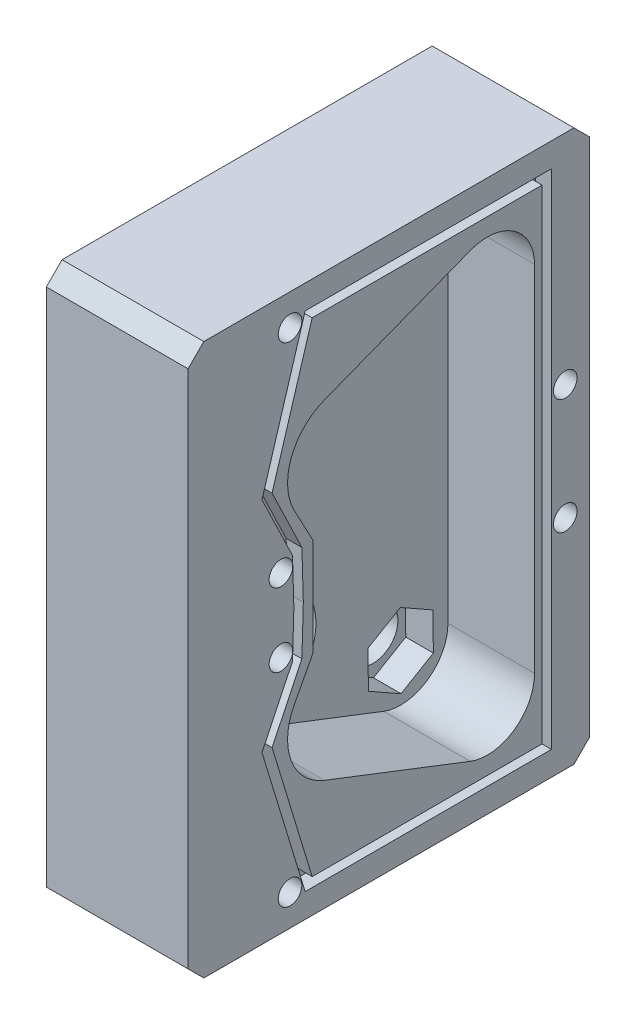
ISO-10303-21;
HEADER;
FILE_DESCRIPTION(('STEP AP214'),'2;1');
FILE_NAME('part.step','',(''),(''),'','','');
FILE_SCHEMA(('AUTOMOTIVE_DESIGN { 1 0 10303 214 1 1 1 1 }'));
ENDSEC;
DATA;
#1=APPLICATION_CONTEXT('core data for automotive mechanical design processes');
#2=APPLICATION_PROTOCOL_DEFINITION('international standard','automotive_design',2000,#1);
#3=PRODUCT_CONTEXT('',#1,'mechanical');
#4=PRODUCT('Part','Part','',(#3));
#5=PRODUCT_RELATED_PRODUCT_CATEGORY('part','',(#4));
#6=PRODUCT_DEFINITION_FORMATION('','',#4);
#7=PRODUCT_DEFINITION_CONTEXT('part definition',#1,'design');
#8=PRODUCT_DEFINITION('design','',#6,#7);
#9=PRODUCT_DEFINITION_SHAPE('','',#8);
#10=(LENGTH_UNIT() NAMED_UNIT(*) SI_UNIT(.MILLI.,.METRE.));
#11=(NAMED_UNIT(*) PLANE_ANGLE_UNIT() SI_UNIT($,.RADIAN.));
#12=(NAMED_UNIT(*) SI_UNIT($,.STERADIAN.) SOLID_ANGLE_UNIT());
#13=UNCERTAINTY_MEASURE_WITH_UNIT(LENGTH_MEASURE(1.E-05),#10,'distance_accuracy_value','');
#14=(GEOMETRIC_REPRESENTATION_CONTEXT(3) GLOBAL_UNCERTAINTY_ASSIGNED_CONTEXT((#13)) GLOBAL_UNIT_ASSIGNED_CONTEXT((#10,
#11,#12)) REPRESENTATION_CONTEXT('',''));
#15=CARTESIAN_POINT('',(0.,0.,0.));
#16=DIRECTION('',(0.,0.,1.));
#17=DIRECTION('',(1.,0.,0.));
#18=AXIS2_PLACEMENT_3D('',#15,#16,#17);
#19=CARTESIAN_POINT('',(-120.319608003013,0.,-51.));
#20=DIRECTION('',(1.,0.,0.));
#21=DIRECTION('',(0.,0.,-1.));
#22=AXIS2_PLACEMENT_3D('',#19,#20,#21);
#23=PLANE('',#22);
#24=DIRECTION('',(0.,-0.999559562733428,0.0296762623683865));
#25=VECTOR('',#24,1.);
#26=CARTESIAN_POINT('',(-120.319608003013,34.8005662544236,-14.6361599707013));
#27=LINE('',#26,#25);
#28=CARTESIAN_POINT('',(-120.319608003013,34.8005662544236,-14.6361599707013));
#29=VERTEX_POINT('',#28);
#30=CARTESIAN_POINT('',(-120.319608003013,28.6788361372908,-14.4544098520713));
#31=VERTEX_POINT('',#30);
#32=EDGE_CURVE('E488',#29,#31,#27,.T.);
#33=ORIENTED_EDGE('',*,*,#32,.T.);
#34=DIRECTION('',(0.,-0.901158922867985,0.433488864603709));
#35=VECTOR('',#34,1.);
#36=CARTESIAN_POINT('',(-120.319608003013,28.6788361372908,-14.4544098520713));
#37=LINE('',#36,#35);
#38=CARTESIAN_POINT('',(-120.319608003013,20.8093917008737,-10.6689326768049));
#39=VERTEX_POINT('',#38);
#40=EDGE_CURVE('E517',#31,#39,#37,.T.);
#41=ORIENTED_EDGE('',*,*,#40,.T.);
#42=DIRECTION('',(0.,-0.9567439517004,-0.290931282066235));
#43=VECTOR('',#42,1.);
#44=CARTESIAN_POINT('',(-120.319608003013,20.8093917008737,-10.6689326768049));
#45=LINE('',#44,#43);
#46=CARTESIAN_POINT('',(-120.319608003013,4.070205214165,-15.7590646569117));
#47=VERTEX_POINT('',#46);
#48=EDGE_CURVE('E520',#39,#47,#45,.T.);
#49=ORIENTED_EDGE('',*,*,#48,.T.);
#50=DIRECTION('',(0.,0.,-1.));
#51=VECTOR('',#50,1.);
#52=CARTESIAN_POINT('',(-120.319608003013,4.070205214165,-15.7590646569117));
#53=LINE('',#52,#51);
#54=CARTESIAN_POINT('',(-120.319608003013,4.070205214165,-44.949078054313));
#55=VERTEX_POINT('',#54);
#56=EDGE_CURVE('E523',#47,#55,#53,.T.);
#57=ORIENTED_EDGE('',*,*,#56,.T.);
#58=DIRECTION('',(0.,1.,0.));
#59=VECTOR('',#58,1.);
#60=CARTESIAN_POINT('',(-120.319608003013,4.070205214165,-44.949078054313));
#61=LINE('',#60,#59);
#62=CARTESIAN_POINT('',(-120.319608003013,65.5309272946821,-44.949078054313));
#63=VERTEX_POINT('',#62);
#64=EDGE_CURVE('E526',#55,#63,#61,.T.);
#65=ORIENTED_EDGE('',*,*,#64,.T.);
#66=DIRECTION('',(0.,0.,1.));
#67=VECTOR('',#66,1.);
#68=CARTESIAN_POINT('',(-120.319608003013,65.5309272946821,-15.7590646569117));
#69=LINE('',#68,#67);
#70=CARTESIAN_POINT('',(-120.319608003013,65.5309272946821,-15.7590646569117));
#71=VERTEX_POINT('',#70);
#72=EDGE_CURVE('E530',#63,#71,#69,.T.);
#73=ORIENTED_EDGE('',*,*,#72,.T.);
#74=DIRECTION('',(0.,-0.9567439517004,0.290931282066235));
#75=VECTOR('',#74,1.);
#76=CARTESIAN_POINT('',(-120.319608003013,48.7917408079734,-10.6689326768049));
#77=LINE('',#76,#75);
#78=CARTESIAN_POINT('',(-120.319608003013,48.7917408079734,-10.6689326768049));
#79=VERTEX_POINT('',#78);
#80=EDGE_CURVE('E534',#71,#79,#77,.T.);
#81=ORIENTED_EDGE('',*,*,#80,.T.);
#82=DIRECTION('',(0.,-0.901158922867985,-0.433488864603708));
#83=VECTOR('',#82,1.);
#84=CARTESIAN_POINT('',(-120.319608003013,40.9222963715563,-14.4544098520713));
#85=LINE('',#84,#83);
#86=CARTESIAN_POINT('',(-120.319608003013,40.9222963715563,-14.4544098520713));
#87=VERTEX_POINT('',#86);
#88=EDGE_CURVE('E538',#79,#87,#85,.T.);
#89=ORIENTED_EDGE('',*,*,#88,.T.);
#90=DIRECTION('',(0.,-0.999559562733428,-0.0296762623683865));
#91=VECTOR('',#90,1.);
#92=CARTESIAN_POINT('',(-120.319608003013,34.8005662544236,-14.6361599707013));
#93=LINE('',#92,#91);
#94=EDGE_CURVE('E541',#87,#29,#93,.T.);
#95=ORIENTED_EDGE('',*,*,#94,.T.);
#96=EDGE_LOOP('',(#33,#41,#49,#57,#65,#73,#81,#89,#95));
#97=FACE_BOUND('',#96,.T.);
#98=CARTESIAN_POINT('',(-120.319608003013,48.9035046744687,-19.9354728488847));
#99=DIRECTION('',(-1.,0.,0.));
#100=DIRECTION('',(0.,0.,1.));
#101=AXIS2_PLACEMENT_3D('',#98,#99,#100);
#102=CIRCLE('',#101,7.3);
#103=CARTESIAN_POINT('',(-120.319608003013,45.4845691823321,-13.4855984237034));
#104=VERTEX_POINT('',#103);
#105=CARTESIAN_POINT('',(-120.319608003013,55.7108554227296,-17.2991921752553));
#106=VERTEX_POINT('',#105);
#107=EDGE_CURVE('E767',#104,#106,#102,.T.);
#108=ORIENTED_EDGE('',*,*,#107,.T.);
#109=DIRECTION('',(0.,0.361134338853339,-0.93251380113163));
#110=VECTOR('',#109,1.);
#111=CARTESIAN_POINT('',(-120.319608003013,42.6194328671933,16.5052149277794));
#112=LINE('',#111,#110);
#113=CARTESIAN_POINT('',(-120.319608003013,62.8885127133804,-35.83319396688));
#114=VERTEX_POINT('',#113);
#115=EDGE_CURVE('E369',#106,#114,#112,.T.);
#116=ORIENTED_EDGE('',*,*,#115,.T.);
#117=CARTESIAN_POINT('',(-120.319608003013,57.2934299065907,-38.));
#118=DIRECTION('',(-1.,0.,0.));
#119=DIRECTION('',(0.,0.,1.));
#120=AXIS2_PLACEMENT_3D('',#117,#118,#119);
#121=CIRCLE('',#120,6.);
#122=CARTESIAN_POINT('',(-120.319608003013,57.2934299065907,-44.));
#123=VERTEX_POINT('',#122);
#124=EDGE_CURVE('E667',#114,#123,#121,.T.);
#125=ORIENTED_EDGE('',*,*,#124,.T.);
#126=DIRECTION('',(0.,-1.,0.));
#127=VECTOR('',#126,1.);
#128=CARTESIAN_POINT('',(-120.319608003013,0.,-44.));
#129=LINE('',#128,#127);
#130=CARTESIAN_POINT('',(-120.319608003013,12.3077026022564,-44.));
#131=VERTEX_POINT('',#130);
#132=EDGE_CURVE('E387',#123,#131,#129,.T.);
#133=ORIENTED_EDGE('',*,*,#132,.T.);
#134=CARTESIAN_POINT('',(-120.319608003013,12.3077026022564,-38.));
#135=DIRECTION('',(-1.,0.,0.));
#136=DIRECTION('',(0.,0.,1.));
#137=AXIS2_PLACEMENT_3D('',#134,#135,#136);
#138=CIRCLE('',#137,6.);
#139=CARTESIAN_POINT('',(-120.319608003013,6.71261979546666,-35.83319396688));
#140=VERTEX_POINT('',#139);
#141=EDGE_CURVE('E674',#131,#140,#138,.T.);
#142=ORIENTED_EDGE('',*,*,#141,.T.);
#143=DIRECTION('',(0.,-0.361134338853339,-0.93251380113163));
#144=VECTOR('',#143,1.);
#145=CARTESIAN_POINT('',(-120.319608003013,17.9044583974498,-6.9338542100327));
#146=LINE('',#145,#144);
#147=CARTESIAN_POINT('',(-120.319608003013,13.8902770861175,-17.2991921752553));
#148=VERTEX_POINT('',#147);
#149=EDGE_CURVE('E418',#148,#140,#146,.T.);
#150=ORIENTED_EDGE('',*,*,#149,.F.);
#151=CARTESIAN_POINT('',(-120.319608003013,20.6976278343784,-19.9354728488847));
#152=DIRECTION('',(-1.,0.,0.));
#153=DIRECTION('',(0.,0.,1.));
#154=AXIS2_PLACEMENT_3D('',#151,#152,#153);
#155=CIRCLE('',#154,7.3);
#156=CARTESIAN_POINT('',(-120.319608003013,24.116563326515,-13.4855984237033));
#157=VERTEX_POINT('',#156);
#158=EDGE_CURVE('E779',#148,#157,#155,.T.);
#159=ORIENTED_EDGE('',*,*,#158,.T.);
#160=DIRECTION('',(0.,0.883544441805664,-0.468347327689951));
#161=VECTOR('',#160,1.);
#162=CARTESIAN_POINT('',(-120.319608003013,-0.29046786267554,-0.547972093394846));
#163=LINE('',#162,#161);
#164=CARTESIAN_POINT('',(-120.319608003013,28.6364668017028,-15.8814990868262));
#165=VERTEX_POINT('',#164);
#166=EDGE_CURVE('E415',#157,#165,#163,.T.);
#167=ORIENTED_EDGE('',*,*,#166,.T.);
#168=DIRECTION('',(0.,1.,0.));
#169=VECTOR('',#168,1.);
#170=CARTESIAN_POINT('',(-120.319608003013,0.,-15.8814990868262));
#171=LINE('',#170,#169);
#172=CARTESIAN_POINT('',(-120.319608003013,40.9646657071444,-15.8814990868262));
#173=VERTEX_POINT('',#172);
#174=EDGE_CURVE('E411',#165,#173,#171,.T.);
#175=ORIENTED_EDGE('',*,*,#174,.T.);
#176=DIRECTION('',(0.,0.883544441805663,0.468347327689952));
#177=VECTOR('',#176,1.);
#178=CARTESIAN_POINT('',(-120.319608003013,15.5574219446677,-29.3493159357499));
#179=LINE('',#178,#177);
#180=EDGE_CURVE('E407',#173,#104,#179,.T.);
#181=ORIENTED_EDGE('',*,*,#180,.T.);
#182=EDGE_LOOP('',(#108,#116,#125,#133,#142,#150,#159,#167,#175,#181));
#183=FACE_BOUND('',#182,.T.);
#184=ADVANCED_FACE('F51',(#97,#183),#23,.T.);
#185=CARTESIAN_POINT('',(-120.319608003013,20.6976278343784,-19.9354728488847));
#186=DIRECTION('',(-1.,0.,0.));
#187=DIRECTION('',(0.,0.,1.));
#188=AXIS2_PLACEMENT_3D('',#185,#186,#187);
#189=CYLINDRICAL_SURFACE('',#188,7.3);
#190=CARTESIAN_POINT('',(-138.319608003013,20.6976278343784,-19.9354728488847));
#191=DIRECTION('',(-1.,0.,0.));
#192=DIRECTION('',(0.,0.,1.));
#193=AXIS2_PLACEMENT_3D('',#190,#191,#192);
#194=CIRCLE('',#193,7.3);
#195=CARTESIAN_POINT('',(-138.319608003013,20.6976278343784,-12.6354728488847));
#196=VERTEX_POINT('',#195);
#197=EDGE_CURVE('E769',#196,#196,#194,.T.);
#198=ORIENTED_EDGE('',*,*,#197,.T.);
#199=EDGE_LOOP('',(#198));
#200=FACE_BOUND('',#199,.T.);
#201=DIRECTION('',(1.,0.,0.));
#202=VECTOR('',#201,1.);
#203=CARTESIAN_POINT('',(-131.319608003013,13.8902770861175,-17.2991921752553));
#204=LINE('',#203,#202);
#205=CARTESIAN_POINT('',(-131.319608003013,13.8902770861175,-17.2991921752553));
#206=VERTEX_POINT('',#205);
#207=EDGE_CURVE('E434',#206,#148,#204,.T.);
#208=ORIENTED_EDGE('',*,*,#207,.F.);
#209=CARTESIAN_POINT('',(-131.319608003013,20.6976278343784,-19.9354728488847));
#210=DIRECTION('',(1.,0.,0.));
#211=DIRECTION('',(0.,0.,-1.));
#212=AXIS2_PLACEMENT_3D('',#209,#210,#211);
#213=CIRCLE('',#212,7.3);
#214=CARTESIAN_POINT('',(-131.319608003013,24.116563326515,-13.4855984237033));
#215=VERTEX_POINT('',#214);
#216=EDGE_CURVE('E400',#215,#206,#213,.F.);
#217=ORIENTED_EDGE('',*,*,#216,.F.);
#218=DIRECTION('',(1.,0.,0.));
#219=VECTOR('',#218,1.);
#220=CARTESIAN_POINT('',(-131.319608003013,24.116563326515,-13.4855984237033));
#221=LINE('',#220,#219);
#222=EDGE_CURVE('E436',#215,#157,#221,.T.);
#223=ORIENTED_EDGE('',*,*,#222,.T.);
#224=ORIENTED_EDGE('',*,*,#158,.F.);
#225=EDGE_LOOP('',(#208,#217,#223,#224));
#226=FACE_BOUND('',#225,.T.);
#227=ADVANCED_FACE('F888',(#200,#226),#189,.F.);
#228=CARTESIAN_POINT('',(-120.319608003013,57.2934299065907,-38.));
#229=DIRECTION('',(-1.,0.,0.));
#230=DIRECTION('',(0.,0.,1.));
#231=AXIS2_PLACEMENT_3D('',#228,#229,#230);
#232=CYLINDRICAL_SURFACE('',#231,6.);
#233=DIRECTION('',(1.,0.,0.));
#234=VECTOR('',#233,1.);
#235=CARTESIAN_POINT('',(-131.319608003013,62.8885127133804,-35.83319396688));
#236=LINE('',#235,#234);
#237=CARTESIAN_POINT('',(-131.319608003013,62.8885127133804,-35.83319396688));
#238=VERTEX_POINT('',#237);
#239=EDGE_CURVE('E423',#238,#114,#236,.T.);
#240=ORIENTED_EDGE('',*,*,#239,.F.);
#241=CARTESIAN_POINT('',(-131.319608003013,57.2934299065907,-38.));
#242=DIRECTION('',(-1.,0.,0.));
#243=DIRECTION('',(0.,0.,1.));
#244=AXIS2_PLACEMENT_3D('',#241,#242,#243);
#245=CIRCLE('',#244,6.);
#246=CARTESIAN_POINT('',(-131.319608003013,57.2934299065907,-44.));
#247=VERTEX_POINT('',#246);
#248=EDGE_CURVE('E386',#238,#247,#245,.T.);
#249=ORIENTED_EDGE('',*,*,#248,.T.);
#250=DIRECTION('',(1.,0.,0.));
#251=VECTOR('',#250,1.);
#252=CARTESIAN_POINT('',(-131.319608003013,57.2934299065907,-44.));
#253=LINE('',#252,#251);
#254=EDGE_CURVE('E426',#247,#123,#253,.T.);
#255=ORIENTED_EDGE('',*,*,#254,.T.);
#256=ORIENTED_EDGE('',*,*,#124,.F.);
#257=EDGE_LOOP('',(#240,#249,#255,#256));
#258=FACE_BOUND('',#257,.T.);
#259=ADVANCED_FACE('F882',(#258),#232,.F.);
#260=CARTESIAN_POINT('',(-120.319608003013,12.3077026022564,-38.));
#261=DIRECTION('',(-1.,0.,0.));
#262=DIRECTION('',(0.,0.,1.));
#263=AXIS2_PLACEMENT_3D('',#260,#261,#262);
#264=CYLINDRICAL_SURFACE('',#263,6.);
#265=DIRECTION('',(1.,0.,0.));
#266=VECTOR('',#265,1.);
#267=CARTESIAN_POINT('',(-131.319608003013,12.3077026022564,-44.));
#268=LINE('',#267,#266);
#269=CARTESIAN_POINT('',(-131.319608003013,12.3077026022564,-44.));
#270=VERTEX_POINT('',#269);
#271=EDGE_CURVE('E429',#270,#131,#268,.T.);
#272=ORIENTED_EDGE('',*,*,#271,.F.);
#273=CARTESIAN_POINT('',(-131.319608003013,12.3077026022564,-38.));
#274=DIRECTION('',(-1.,0.,0.));
#275=DIRECTION('',(0.,0.,1.));
#276=AXIS2_PLACEMENT_3D('',#273,#274,#275);
#277=CIRCLE('',#276,6.);
#278=CARTESIAN_POINT('',(-131.319608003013,6.71261979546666,-35.83319396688));
#279=VERTEX_POINT('',#278);
#280=EDGE_CURVE('E687',#270,#279,#277,.T.);
#281=ORIENTED_EDGE('',*,*,#280,.T.);
#282=DIRECTION('',(1.,0.,0.));
#283=VECTOR('',#282,1.);
#284=CARTESIAN_POINT('',(-131.319608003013,6.71261979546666,-35.83319396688));
#285=LINE('',#284,#283);
#286=EDGE_CURVE('E431',#279,#140,#285,.T.);
#287=ORIENTED_EDGE('',*,*,#286,.T.);
#288=ORIENTED_EDGE('',*,*,#141,.F.);
#289=EDGE_LOOP('',(#272,#281,#287,#288));
#290=FACE_BOUND('',#289,.T.);
#291=ADVANCED_FACE('F871',(#290),#264,.F.);
#292=CARTESIAN_POINT('',(-120.319608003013,42.1250775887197,-47.9));
#293=DIRECTION('',(-1.,0.,0.));
#294=DIRECTION('',(0.,0.,1.));
#295=AXIS2_PLACEMENT_3D('',#292,#293,#294);
#296=CYLINDRICAL_SURFACE('',#295,1.5);
#297=CARTESIAN_POINT('',(-120.319608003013,42.1250775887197,-47.9));
#298=DIRECTION('',(-1.,0.,0.));
#299=DIRECTION('',(0.,0.,1.));
#300=AXIS2_PLACEMENT_3D('',#297,#298,#299);
#301=CIRCLE('',#300,1.5);
#302=CARTESIAN_POINT('',(-120.319608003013,42.1250775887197,-46.4));
#303=VERTEX_POINT('',#302);
#304=EDGE_CURVE('E659',#303,#303,#301,.T.);
#305=ORIENTED_EDGE('',*,*,#304,.F.);
#306=EDGE_LOOP('',(#305));
#307=FACE_BOUND('',#306,.T.);
#308=CARTESIAN_POINT('',(-126.319608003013,42.1250775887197,-47.9));
#309=DIRECTION('',(-1.,0.,0.));
#310=DIRECTION('',(0.,0.,1.));
#311=AXIS2_PLACEMENT_3D('',#308,#309,#310);
#312=CIRCLE('',#311,1.5);
#313=CARTESIAN_POINT('',(-126.319608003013,42.1250775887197,-46.4));
#314=VERTEX_POINT('',#313);
#315=EDGE_CURVE('E56',#314,#314,#312,.F.);
#316=ORIENTED_EDGE('',*,*,#315,.F.);
#317=EDGE_LOOP('',(#316));
#318=FACE_BOUND('',#317,.T.);
#319=ADVANCED_FACE('F868',(#307,#318),#296,.F.);
#320=CARTESIAN_POINT('',(-120.319608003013,39.4535272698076,-11.7954023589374));
#321=DIRECTION('',(-1.,0.,0.));
#322=DIRECTION('',(0.,0.,1.));
#323=AXIS2_PLACEMENT_3D('',#320,#321,#322);
#324=CYLINDRICAL_SURFACE('',#323,1.5);
#325=CARTESIAN_POINT('',(-120.319608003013,39.4535272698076,-11.7954023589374));
#326=DIRECTION('',(-1.,0.,0.));
#327=DIRECTION('',(0.,0.,1.));
#328=AXIS2_PLACEMENT_3D('',#325,#326,#327);
#329=CIRCLE('',#328,1.5);
#330=CARTESIAN_POINT('',(-120.319608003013,39.4535272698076,-10.2954023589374));
#331=VERTEX_POINT('',#330);
#332=EDGE_CURVE('E630',#331,#331,#329,.T.);
#333=ORIENTED_EDGE('',*,*,#332,.F.);
#334=EDGE_LOOP('',(#333));
#335=FACE_BOUND('',#334,.T.);
#336=CARTESIAN_POINT('',(-126.319608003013,39.4535272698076,-11.7954023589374));
#337=DIRECTION('',(-1.,0.,0.));
#338=DIRECTION('',(0.,0.,1.));
#339=AXIS2_PLACEMENT_3D('',#336,#337,#338);
#340=CIRCLE('',#339,1.5);
#341=CARTESIAN_POINT('',(-126.319608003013,39.4535272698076,-10.2954023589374));
#342=VERTEX_POINT('',#341);
#343=EDGE_CURVE('E858',#342,#342,#340,.F.);
#344=ORIENTED_EDGE('',*,*,#343,.F.);
#345=EDGE_LOOP('',(#344));
#346=FACE_BOUND('',#345,.T.);
#347=ADVANCED_FACE('F870',(#335,#346),#324,.F.);
#348=CARTESIAN_POINT('',(-120.319608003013,27.4760549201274,-47.9));
#349=DIRECTION('',(-1.,0.,0.));
#350=DIRECTION('',(0.,0.,1.));
#351=AXIS2_PLACEMENT_3D('',#348,#349,#350);
#352=CYLINDRICAL_SURFACE('',#351,1.5);
#353=CARTESIAN_POINT('',(-120.319608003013,27.4760549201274,-47.9));
#354=DIRECTION('',(-1.,0.,0.));
#355=DIRECTION('',(0.,0.,1.));
#356=AXIS2_PLACEMENT_3D('',#353,#354,#355);
#357=CIRCLE('',#356,1.5);
#358=CARTESIAN_POINT('',(-120.319608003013,27.4760549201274,-46.4));
#359=VERTEX_POINT('',#358);
#360=EDGE_CURVE('E656',#359,#359,#357,.T.);
#361=ORIENTED_EDGE('',*,*,#360,.F.);
#362=EDGE_LOOP('',(#361));
#363=FACE_BOUND('',#362,.T.);
#364=CARTESIAN_POINT('',(-126.319608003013,27.4760549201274,-47.9));
#365=DIRECTION('',(-1.,0.,0.));
#366=DIRECTION('',(0.,0.,1.));
#367=AXIS2_PLACEMENT_3D('',#364,#365,#366);
#368=CIRCLE('',#367,1.5);
#369=CARTESIAN_POINT('',(-126.319608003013,27.4760549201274,-46.4));
#370=VERTEX_POINT('',#369);
#371=EDGE_CURVE('E855',#370,#370,#368,.F.);
#372=ORIENTED_EDGE('',*,*,#371,.F.);
#373=EDGE_LOOP('',(#372));
#374=FACE_BOUND('',#373,.T.);
#375=ADVANCED_FACE('F878',(#363,#374),#352,.F.);
#376=CARTESIAN_POINT('',(-120.319608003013,65.8396830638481,-12.9477925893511));
#377=DIRECTION('',(-1.,0.,0.));
#378=DIRECTION('',(0.,0.,1.));
#379=AXIS2_PLACEMENT_3D('',#376,#377,#378);
#380=CYLINDRICAL_SURFACE('',#379,1.5);
#381=CARTESIAN_POINT('',(-120.319608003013,65.8396830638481,-12.9477925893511));
#382=DIRECTION('',(-1.,0.,0.));
#383=DIRECTION('',(0.,0.,1.));
#384=AXIS2_PLACEMENT_3D('',#381,#382,#383);
#385=CIRCLE('',#384,1.5);
#386=CARTESIAN_POINT('',(-120.319608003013,65.8396830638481,-11.4477925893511));
#387=VERTEX_POINT('',#386);
#388=EDGE_CURVE('E653',#387,#387,#385,.T.);
#389=ORIENTED_EDGE('',*,*,#388,.F.);
#390=EDGE_LOOP('',(#389));
#391=FACE_BOUND('',#390,.T.);
#392=CARTESIAN_POINT('',(-126.319608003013,65.8396830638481,-12.9477925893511));
#393=DIRECTION('',(-1.,0.,0.));
#394=DIRECTION('',(0.,0.,1.));
#395=AXIS2_PLACEMENT_3D('',#392,#393,#394);
#396=CIRCLE('',#395,1.5);
#397=CARTESIAN_POINT('',(-126.319608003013,65.8396830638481,-11.4477925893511));
#398=VERTEX_POINT('',#397);
#399=EDGE_CURVE('E852',#398,#398,#396,.F.);
#400=ORIENTED_EDGE('',*,*,#399,.F.);
#401=EDGE_LOOP('',(#400));
#402=FACE_BOUND('',#401,.T.);
#403=ADVANCED_FACE('F1170',(#391,#402),#380,.F.);
#404=CARTESIAN_POINT('',(-120.319608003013,3.76144944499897,-12.9477925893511));
#405=DIRECTION('',(-1.,0.,0.));
#406=DIRECTION('',(0.,0.,1.));
#407=AXIS2_PLACEMENT_3D('',#404,#405,#406);
#408=CYLINDRICAL_SURFACE('',#407,1.5);
#409=CARTESIAN_POINT('',(-120.319608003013,3.76144944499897,-12.9477925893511));
#410=DIRECTION('',(-1.,0.,0.));
#411=DIRECTION('',(0.,0.,1.));
#412=AXIS2_PLACEMENT_3D('',#409,#410,#411);
#413=CIRCLE('',#412,1.5);
#414=CARTESIAN_POINT('',(-120.319608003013,3.76144944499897,-11.4477925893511));
#415=VERTEX_POINT('',#414);
#416=EDGE_CURVE('E650',#415,#415,#413,.T.);
#417=ORIENTED_EDGE('',*,*,#416,.F.);
#418=EDGE_LOOP('',(#417));
#419=FACE_BOUND('',#418,.T.);
#420=CARTESIAN_POINT('',(-126.319608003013,3.76144944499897,-12.9477925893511));
#421=DIRECTION('',(-1.,0.,0.));
#422=DIRECTION('',(0.,0.,1.));
#423=AXIS2_PLACEMENT_3D('',#420,#421,#422);
#424=CIRCLE('',#423,1.5);
#425=CARTESIAN_POINT('',(-126.319608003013,3.76144944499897,-11.4477925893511));
#426=VERTEX_POINT('',#425);
#427=EDGE_CURVE('E849',#426,#426,#424,.F.);
#428=ORIENTED_EDGE('',*,*,#427,.F.);
#429=EDGE_LOOP('',(#428));
#430=FACE_BOUND('',#429,.T.);
#431=ADVANCED_FACE('F911',(#419,#430),#408,.F.);
#432=CARTESIAN_POINT('',(-120.319608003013,30.1476052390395,-11.7954023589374));
#433=DIRECTION('',(-1.,0.,0.));
#434=DIRECTION('',(0.,0.,1.));
#435=AXIS2_PLACEMENT_3D('',#432,#433,#434);
#436=CYLINDRICAL_SURFACE('',#435,1.5);
#437=CARTESIAN_POINT('',(-120.319608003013,30.1476052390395,-11.7954023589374));
#438=DIRECTION('',(-1.,0.,0.));
#439=DIRECTION('',(0.,0.,1.));
#440=AXIS2_PLACEMENT_3D('',#437,#438,#439);
#441=CIRCLE('',#440,1.5);
#442=CARTESIAN_POINT('',(-120.319608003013,30.1476052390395,-10.2954023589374));
#443=VERTEX_POINT('',#442);
#444=EDGE_CURVE('E649',#443,#443,#441,.T.);
#445=ORIENTED_EDGE('',*,*,#444,.F.);
#446=EDGE_LOOP('',(#445));
#447=FACE_BOUND('',#446,.T.);
#448=CARTESIAN_POINT('',(-126.319608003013,30.1476052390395,-11.7954023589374));
#449=DIRECTION('',(-1.,0.,0.));
#450=DIRECTION('',(0.,0.,1.));
#451=AXIS2_PLACEMENT_3D('',#448,#449,#450);
#452=CIRCLE('',#451,1.5);
#453=CARTESIAN_POINT('',(-126.319608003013,30.1476052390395,-10.2954023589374));
#454=VERTEX_POINT('',#453);
#455=EDGE_CURVE('E447',#454,#454,#452,.F.);
#456=ORIENTED_EDGE('',*,*,#455,.F.);
#457=EDGE_LOOP('',(#456));
#458=FACE_BOUND('',#457,.T.);
#459=ADVANCED_FACE('F901',(#447,#458),#436,.F.);
#460=DIRECTION('',(0.,-0.999559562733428,-0.0296762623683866));
#461=VECTOR('',#460,1.);
#462=CARTESIAN_POINT('',(-120.319608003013,34.8005662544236,-13.4356312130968));
#463=LINE('',#462,#461);
#464=CARTESIAN_POINT('',(-120.319608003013,40.6318540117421,-13.2625041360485));
#465=VERTEX_POINT('',#464);
#466=CARTESIAN_POINT('',(-120.319608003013,34.8005662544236,-13.4356312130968));
#467=VERTEX_POINT('',#466);
#468=EDGE_CURVE('E80',#465,#467,#463,.T.);
#469=ORIENTED_EDGE('',*,*,#468,.F.);
#470=DIRECTION('',(0.,-0.901158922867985,-0.433488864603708));
#471=VECTOR('',#470,1.);
#472=CARTESIAN_POINT('',(-120.319608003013,40.6318540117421,-13.2625041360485));
#473=LINE('',#472,#471);
#474=CARTESIAN_POINT('',(-120.319608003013,48.6932022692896,-9.38471453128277));
#475=VERTEX_POINT('',#474);
#476=EDGE_CURVE('E572',#475,#465,#473,.T.);
#477=ORIENTED_EDGE('',*,*,#476,.F.);
#478=DIRECTION('',(0.,-0.9567439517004,0.290931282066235));
#479=VECTOR('',#478,1.);
#480=CARTESIAN_POINT('',(-120.319608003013,48.6932022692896,-9.38471453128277));
#481=LINE('',#480,#479);
#482=CARTESIAN_POINT('',(-120.319608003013,66.7309272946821,-14.8697123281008));
#483=VERTEX_POINT('',#482);
#484=EDGE_CURVE('E622',#483,#475,#481,.T.);
#485=ORIENTED_EDGE('',*,*,#484,.F.);
#486=DIRECTION('',(0.,0.,1.));
#487=VECTOR('',#486,1.);
#488=CARTESIAN_POINT('',(-120.319608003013,66.7309272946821,-14.8697123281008));
#489=LINE('',#488,#487);
#490=CARTESIAN_POINT('',(-120.319608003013,66.7309272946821,-46.149078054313));
#491=VERTEX_POINT('',#490);
#492=EDGE_CURVE('E619',#491,#483,#489,.T.);
#493=ORIENTED_EDGE('',*,*,#492,.F.);
#494=DIRECTION('',(0.,1.,0.));
#495=VECTOR('',#494,1.);
#496=CARTESIAN_POINT('',(-120.319608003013,2.870205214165,-46.149078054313));
#497=LINE('',#496,#495);
#498=CARTESIAN_POINT('',(-120.319608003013,2.870205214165,-46.149078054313));
#499=VERTEX_POINT('',#498);
#500=EDGE_CURVE('E615',#499,#491,#497,.T.);
#501=ORIENTED_EDGE('',*,*,#500,.F.);
#502=DIRECTION('',(0.,0.,-1.));
#503=VECTOR('',#502,1.);
#504=CARTESIAN_POINT('',(-120.319608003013,2.870205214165,-14.8697123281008));
#505=LINE('',#504,#503);
#506=CARTESIAN_POINT('',(-120.319608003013,2.870205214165,-14.8697123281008));
#507=VERTEX_POINT('',#506);
#508=EDGE_CURVE('E612',#507,#499,#505,.T.);
#509=ORIENTED_EDGE('',*,*,#508,.F.);
#510=DIRECTION('',(0.,-0.9567439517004,-0.290931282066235));
#511=VECTOR('',#510,1.);
#512=CARTESIAN_POINT('',(-120.319608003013,20.9079302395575,-9.38471453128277));
#513=LINE('',#512,#511);
#514=CARTESIAN_POINT('',(-120.319608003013,20.9079302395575,-9.38471453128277));
#515=VERTEX_POINT('',#514);
#516=EDGE_CURVE('E609',#515,#507,#513,.T.);
#517=ORIENTED_EDGE('',*,*,#516,.F.);
#518=DIRECTION('',(0.,-0.901158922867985,0.433488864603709));
#519=VECTOR('',#518,1.);
#520=CARTESIAN_POINT('',(-120.319608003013,28.969278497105,-13.2625041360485));
#521=LINE('',#520,#519);
#522=CARTESIAN_POINT('',(-120.319608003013,28.969278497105,-13.2625041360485));
#523=VERTEX_POINT('',#522);
#524=EDGE_CURVE('E606',#523,#515,#521,.T.);
#525=ORIENTED_EDGE('',*,*,#524,.F.);
#526=DIRECTION('',(0.,-0.999559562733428,0.0296762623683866));
#527=VECTOR('',#526,1.);
#528=CARTESIAN_POINT('',(-120.319608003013,34.8005662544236,-13.4356312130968));
#529=LINE('',#528,#527);
#530=EDGE_CURVE('E602',#467,#523,#529,.T.);
#531=ORIENTED_EDGE('',*,*,#530,.F.);
#532=EDGE_LOOP('',(#469,#477,#485,#493,#501,#509,#517,#525,#531));
#533=FACE_BOUND('',#532,.T.);
#534=ORIENTED_EDGE('',*,*,#444,.T.);
#535=EDGE_LOOP('',(#534));
#536=FACE_BOUND('',#535,.T.);
#537=ORIENTED_EDGE('',*,*,#416,.T.);
#538=EDGE_LOOP('',(#537));
#539=FACE_BOUND('',#538,.T.);
#540=ORIENTED_EDGE('',*,*,#388,.T.);
#541=EDGE_LOOP('',(#540));
#542=FACE_BOUND('',#541,.T.);
#543=ORIENTED_EDGE('',*,*,#360,.T.);
#544=EDGE_LOOP('',(#543));
#545=FACE_BOUND('',#544,.T.);
#546=ORIENTED_EDGE('',*,*,#332,.T.);
#547=EDGE_LOOP('',(#546));
#548=FACE_BOUND('',#547,.T.);
#549=ORIENTED_EDGE('',*,*,#304,.T.);
#550=EDGE_LOOP('',(#549));
#551=FACE_BOUND('',#550,.T.);
#552=DIRECTION('',(0.,1.,0.));
#553=VECTOR('',#552,1.);
#554=CARTESIAN_POINT('',(-120.319608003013,0.,-51.));
#555=LINE('',#554,#553);
#556=CARTESIAN_POINT('',(-120.319608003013,1.80056625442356,-51.));
#557=VERTEX_POINT('',#556);
#558=CARTESIAN_POINT('',(-120.319608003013,67.8005662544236,-51.));
#559=VERTEX_POINT('',#558);
#560=EDGE_CURVE('E786',#557,#559,#555,.T.);
#561=ORIENTED_EDGE('',*,*,#560,.T.);
#562=DIRECTION('',(0.,0.707106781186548,0.707106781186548));
#563=VECTOR('',#562,1.);
#564=CARTESIAN_POINT('',(-120.319608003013,33.9002831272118,-84.9002831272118));
#565=LINE('',#564,#563);
#566=CARTESIAN_POINT('',(-120.319608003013,69.8005662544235,-49.));
#567=VERTEX_POINT('',#566);
#568=EDGE_CURVE('E838',#559,#567,#565,.T.);
#569=ORIENTED_EDGE('',*,*,#568,.T.);
#570=DIRECTION('',(0.,0.,1.));
#571=VECTOR('',#570,1.);
#572=CARTESIAN_POINT('',(-120.319608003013,69.8005662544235,-51.));
#573=LINE('',#572,#571);
#574=CARTESIAN_POINT('',(-120.319608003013,69.8005662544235,-2.00000000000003));
#575=VERTEX_POINT('',#574);
#576=EDGE_CURVE('E795',#567,#575,#573,.T.);
#577=ORIENTED_EDGE('',*,*,#576,.T.);
#578=DIRECTION('',(0.,0.707106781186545,-0.70710678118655));
#579=VECTOR('',#578,1.);
#580=CARTESIAN_POINT('',(-120.319608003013,59.400283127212,8.4002831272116));
#581=LINE('',#580,#579);
#582=CARTESIAN_POINT('',(-120.319608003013,67.8005662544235,0.));
#583=VERTEX_POINT('',#582);
#584=EDGE_CURVE('E836',#575,#583,#581,.F.);
#585=ORIENTED_EDGE('',*,*,#584,.T.);
#586=DIRECTION('',(0.,1.,0.));
#587=VECTOR('',#586,1.);
#588=CARTESIAN_POINT('',(-120.319608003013,0.,0.));
#589=LINE('',#588,#587);
#590=CARTESIAN_POINT('',(-120.319608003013,1.80056625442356,0.));
#591=VERTEX_POINT('',#590);
#592=EDGE_CURVE('E782',#591,#583,#589,.T.);
#593=ORIENTED_EDGE('',*,*,#592,.F.);
#594=DIRECTION('',(0.,-0.707106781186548,-0.707106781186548));
#595=VECTOR('',#594,1.);
#596=CARTESIAN_POINT('',(-120.319608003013,-24.5997168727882,-26.4002831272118));
#597=LINE('',#596,#595);
#598=CARTESIAN_POINT('',(-120.319608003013,-0.199433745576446,-2.));
#599=VERTEX_POINT('',#598);
#600=EDGE_CURVE('E832',#591,#599,#597,.T.);
#601=ORIENTED_EDGE('',*,*,#600,.T.);
#602=DIRECTION('',(0.,0.,1.));
#603=VECTOR('',#602,1.);
#604=CARTESIAN_POINT('',(-120.319608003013,-0.199433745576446,-51.));
#605=LINE('',#604,#603);
#606=CARTESIAN_POINT('',(-120.319608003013,-0.199433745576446,-49.));
#607=VERTEX_POINT('',#606);
#608=EDGE_CURVE('E800',#607,#599,#605,.T.);
#609=ORIENTED_EDGE('',*,*,#608,.F.);
#610=DIRECTION('',(0.,-0.707106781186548,0.707106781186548));
#611=VECTOR('',#610,1.);
#612=CARTESIAN_POINT('',(-120.319608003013,0.900283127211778,-50.0997168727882));
#613=LINE('',#612,#611);
#614=EDGE_CURVE('E834',#607,#557,#613,.F.);
#615=ORIENTED_EDGE('',*,*,#614,.T.);
#616=EDGE_LOOP('',(#561,#569,#577,#585,#593,#601,#609,#615));
#617=FACE_BOUND('',#616,.T.);
#618=ADVANCED_FACE('F891',(#533,#536,#539,#542,#545,#548,#551,#617),#23,.T.);
#619=CARTESIAN_POINT('',(0.,-0.199433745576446,-51.));
#620=DIRECTION('',(0.,1.,0.));
#621=DIRECTION('',(0.,0.,1.));
#622=AXIS2_PLACEMENT_3D('',#619,#620,#621);
#623=PLANE('',#622);
#624=DIRECTION('',(0.,0.,1.));
#625=VECTOR('',#624,1.);
#626=CARTESIAN_POINT('',(-138.319608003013,-0.199433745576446,-51.));
#627=LINE('',#626,#625);
#628=CARTESIAN_POINT('',(-138.319608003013,-0.199433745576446,-49.));
#629=VERTEX_POINT('',#628);
#630=CARTESIAN_POINT('',(-138.319608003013,-0.199433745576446,-2.));
#631=VERTEX_POINT('',#630);
#632=EDGE_CURVE('E804',#629,#631,#627,.T.);
#633=ORIENTED_EDGE('',*,*,#632,.F.);
#634=DIRECTION('',(1.,0.,0.));
#635=VECTOR('',#634,1.);
#636=CARTESIAN_POINT('',(0.,-0.199433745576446,-49.));
#637=LINE('',#636,#635);
#638=EDGE_CURVE('E11',#629,#607,#637,.T.);
#639=ORIENTED_EDGE('',*,*,#638,.T.);
#640=ORIENTED_EDGE('',*,*,#608,.T.);
#641=DIRECTION('',(-1.,0.,0.));
#642=VECTOR('',#641,1.);
#643=CARTESIAN_POINT('',(-138.319608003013,-0.199433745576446,-2.));
#644=LINE('',#643,#642);
#645=EDGE_CURVE('E61',#599,#631,#644,.T.);
#646=ORIENTED_EDGE('',*,*,#645,.T.);
#647=EDGE_LOOP('',(#633,#639,#640,#646));
#648=FACE_BOUND('',#647,.T.);
#649=ADVANCED_FACE('F900',(#648),#623,.F.);
#650=CARTESIAN_POINT('',(-138.319608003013,0.,-51.));
#651=DIRECTION('',(1.,0.,0.));
#652=DIRECTION('',(0.,0.,-1.));
#653=AXIS2_PLACEMENT_3D('',#650,#651,#652);
#654=PLANE('',#653);
#655=CARTESIAN_POINT('',(-138.319608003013,6.47125674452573,-22.1269955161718));
#656=DIRECTION('',(-1.,0.,0.));
#657=DIRECTION('',(0.,0.,1.));
#658=AXIS2_PLACEMENT_3D('',#655,#656,#657);
#659=CIRCLE('',#658,2.125);
#660=CARTESIAN_POINT('',(-138.319608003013,6.47125674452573,-20.0019955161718));
#661=VERTEX_POINT('',#660);
#662=EDGE_CURVE('E976',#661,#661,#659,.T.);
#663=ORIENTED_EDGE('',*,*,#662,.F.);
#664=EDGE_LOOP('',(#663));
#665=FACE_BOUND('',#664,.T.);
#666=CARTESIAN_POINT('',(-138.319608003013,55.7192537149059,-5.5214721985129));
#667=DIRECTION('',(-1.,0.,0.));
#668=DIRECTION('',(0.,0.,1.));
#669=AXIS2_PLACEMENT_3D('',#666,#667,#668);
#670=CIRCLE('',#669,2.125);
#671=CARTESIAN_POINT('',(-138.319608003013,55.7192537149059,-3.39647219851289));
#672=VERTEX_POINT('',#671);
#673=EDGE_CURVE('E980',#672,#672,#670,.T.);
#674=ORIENTED_EDGE('',*,*,#673,.F.);
#675=EDGE_LOOP('',(#674));
#676=FACE_BOUND('',#675,.T.);
#677=CARTESIAN_POINT('',(-138.319608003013,63.1298757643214,-22.1269955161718));
#678=DIRECTION('',(-1.,0.,0.));
#679=DIRECTION('',(0.,0.,1.));
#680=AXIS2_PLACEMENT_3D('',#677,#678,#679);
#681=CIRCLE('',#680,2.125);
#682=CARTESIAN_POINT('',(-138.319608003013,63.1298757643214,-20.0019955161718));
#683=VERTEX_POINT('',#682);
#684=EDGE_CURVE('E984',#683,#683,#681,.T.);
#685=ORIENTED_EDGE('',*,*,#684,.F.);
#686=EDGE_LOOP('',(#685));
#687=FACE_BOUND('',#686,.T.);
#688=CARTESIAN_POINT('',(-138.319608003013,13.8818787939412,-5.5214721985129));
#689=DIRECTION('',(-1.,0.,0.));
#690=DIRECTION('',(0.,0.,1.));
#691=AXIS2_PLACEMENT_3D('',#688,#689,#690);
#692=CIRCLE('',#691,2.125);
#693=CARTESIAN_POINT('',(-138.319608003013,13.8818787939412,-3.39647219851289));
#694=VERTEX_POINT('',#693);
#695=EDGE_CURVE('E988',#694,#694,#692,.T.);
#696=ORIENTED_EDGE('',*,*,#695,.F.);
#697=EDGE_LOOP('',(#696));
#698=FACE_BOUND('',#697,.T.);
#699=CARTESIAN_POINT('',(-138.319608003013,65.8396830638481,-12.9477925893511));
#700=DIRECTION('',(-1.,0.,0.));
#701=DIRECTION('',(0.,0.,1.));
#702=AXIS2_PLACEMENT_3D('',#699,#700,#701);
#703=CIRCLE('',#702,3.);
#704=CARTESIAN_POINT('',(-138.319608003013,65.8396830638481,-9.94779258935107));
#705=VERTEX_POINT('',#704);
#706=EDGE_CURVE('E448',#705,#705,#703,.T.);
#707=ORIENTED_EDGE('',*,*,#706,.F.);
#708=EDGE_LOOP('',(#707));
#709=FACE_BOUND('',#708,.T.);
#710=CARTESIAN_POINT('',(-138.319608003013,27.4760549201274,-47.9));
#711=DIRECTION('',(-1.,0.,0.));
#712=DIRECTION('',(0.,0.,1.));
#713=AXIS2_PLACEMENT_3D('',#710,#711,#712);
#714=CIRCLE('',#713,3.);
#715=CARTESIAN_POINT('',(-138.319608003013,27.4760549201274,-44.9));
#716=VERTEX_POINT('',#715);
#717=EDGE_CURVE('E461',#716,#716,#714,.T.);
#718=ORIENTED_EDGE('',*,*,#717,.F.);
#719=EDGE_LOOP('',(#718));
#720=FACE_BOUND('',#719,.T.);
#721=CARTESIAN_POINT('',(-138.319608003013,42.1250775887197,-47.9));
#722=DIRECTION('',(-1.,0.,0.));
#723=DIRECTION('',(0.,0.,1.));
#724=AXIS2_PLACEMENT_3D('',#721,#722,#723);
#725=CIRCLE('',#724,3.);
#726=CARTESIAN_POINT('',(-138.319608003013,42.1250775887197,-44.9));
#727=VERTEX_POINT('',#726);
#728=EDGE_CURVE('E452',#727,#727,#725,.T.);
#729=ORIENTED_EDGE('',*,*,#728,.F.);
#730=EDGE_LOOP('',(#729));
#731=FACE_BOUND('',#730,.T.);
#732=CARTESIAN_POINT('',(-138.319608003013,3.76144944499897,-12.9477925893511));
#733=DIRECTION('',(-1.,0.,0.));
#734=DIRECTION('',(0.,0.,1.));
#735=AXIS2_PLACEMENT_3D('',#732,#733,#734);
#736=CIRCLE('',#735,3.);
#737=CARTESIAN_POINT('',(-138.319608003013,3.76144944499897,-9.94779258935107));
#738=VERTEX_POINT('',#737);
#739=EDGE_CURVE('E479',#738,#738,#736,.T.);
#740=ORIENTED_EDGE('',*,*,#739,.F.);
#741=EDGE_LOOP('',(#740));
#742=FACE_BOUND('',#741,.T.);
#743=CARTESIAN_POINT('',(-138.319608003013,30.1476052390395,-11.7954023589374));
#744=DIRECTION('',(-1.,0.,0.));
#745=DIRECTION('',(0.,0.,1.));
#746=AXIS2_PLACEMENT_3D('',#743,#744,#745);
#747=CIRCLE('',#746,3.);
#748=CARTESIAN_POINT('',(-138.319608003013,30.1476052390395,-8.79540235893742));
#749=VERTEX_POINT('',#748);
#750=EDGE_CURVE('E473',#749,#749,#747,.T.);
#751=ORIENTED_EDGE('',*,*,#750,.F.);
#752=EDGE_LOOP('',(#751));
#753=FACE_BOUND('',#752,.T.);
#754=CARTESIAN_POINT('',(-138.319608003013,39.4535272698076,-11.7954023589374));
#755=DIRECTION('',(-1.,0.,0.));
#756=DIRECTION('',(0.,0.,1.));
#757=AXIS2_PLACEMENT_3D('',#754,#755,#756);
#758=CIRCLE('',#757,3.);
#759=CARTESIAN_POINT('',(-138.319608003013,39.4535272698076,-8.79540235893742));
#760=VERTEX_POINT('',#759);
#761=EDGE_CURVE('E451',#760,#760,#758,.T.);
#762=ORIENTED_EDGE('',*,*,#761,.F.);
#763=EDGE_LOOP('',(#762));
#764=FACE_BOUND('',#763,.T.);
#765=CARTESIAN_POINT('',(-138.319608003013,12.3077026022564,-38.));
#766=DIRECTION('',(-1.,0.,0.));
#767=DIRECTION('',(0.,0.,1.));
#768=AXIS2_PLACEMENT_3D('',#765,#766,#767);
#769=CIRCLE('',#768,3.15);
#770=CARTESIAN_POINT('',(-138.319608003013,12.3077026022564,-34.85));
#771=VERTEX_POINT('',#770);
#772=EDGE_CURVE('E726',#771,#771,#769,.T.);
#773=ORIENTED_EDGE('',*,*,#772,.F.);
#774=EDGE_LOOP('',(#773));
#775=FACE_BOUND('',#774,.T.);
#776=CARTESIAN_POINT('',(-138.319608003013,57.2934299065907,-38.));
#777=DIRECTION('',(-1.,0.,0.));
#778=DIRECTION('',(0.,0.,1.));
#779=AXIS2_PLACEMENT_3D('',#776,#777,#778);
#780=CIRCLE('',#779,3.15);
#781=CARTESIAN_POINT('',(-138.319608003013,57.2934299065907,-34.85));
#782=VERTEX_POINT('',#781);
#783=EDGE_CURVE('E774',#782,#782,#780,.T.);
#784=ORIENTED_EDGE('',*,*,#783,.F.);
#785=EDGE_LOOP('',(#784));
#786=FACE_BOUND('',#785,.T.);
#787=CARTESIAN_POINT('',(-138.319608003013,48.9035046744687,-19.9354728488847));
#788=DIRECTION('',(-1.,0.,0.));
#789=DIRECTION('',(0.,0.,1.));
#790=AXIS2_PLACEMENT_3D('',#787,#788,#789);
#791=CIRCLE('',#790,7.3);
#792=CARTESIAN_POINT('',(-138.319608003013,48.9035046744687,-12.6354728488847));
#793=VERTEX_POINT('',#792);
#794=EDGE_CURVE('E770',#793,#793,#791,.T.);
#795=ORIENTED_EDGE('',*,*,#794,.F.);
#796=EDGE_LOOP('',(#795));
#797=FACE_BOUND('',#796,.T.);
#798=ORIENTED_EDGE('',*,*,#197,.F.);
#799=EDGE_LOOP('',(#798));
#800=FACE_BOUND('',#799,.T.);
#801=DIRECTION('',(0.,0.,1.));
#802=VECTOR('',#801,1.);
#803=CARTESIAN_POINT('',(-138.319608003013,69.8005662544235,-51.));
#804=LINE('',#803,#802);
#805=CARTESIAN_POINT('',(-138.319608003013,69.8005662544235,-49.));
#806=VERTEX_POINT('',#805);
#807=CARTESIAN_POINT('',(-138.319608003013,69.8005662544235,-2.00000000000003));
#808=VERTEX_POINT('',#807);
#809=EDGE_CURVE('E808',#806,#808,#804,.T.);
#810=ORIENTED_EDGE('',*,*,#809,.F.);
#811=DIRECTION('',(0.,-0.707106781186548,-0.707106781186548));
#812=VECTOR('',#811,1.);
#813=CARTESIAN_POINT('',(-138.319608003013,69.8005662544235,-49.));
#814=LINE('',#813,#812);
#815=CARTESIAN_POINT('',(-138.319608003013,67.8005662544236,-51.));
#816=VERTEX_POINT('',#815);
#817=EDGE_CURVE('E824',#806,#816,#814,.T.);
#818=ORIENTED_EDGE('',*,*,#817,.T.);
#819=DIRECTION('',(0.,1.,0.));
#820=VECTOR('',#819,1.);
#821=CARTESIAN_POINT('',(-138.319608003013,0.,-51.));
#822=LINE('',#821,#820);
#823=CARTESIAN_POINT('',(-138.319608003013,1.80056625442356,-51.));
#824=VERTEX_POINT('',#823);
#825=EDGE_CURVE('E790',#824,#816,#822,.T.);
#826=ORIENTED_EDGE('',*,*,#825,.F.);
#827=DIRECTION('',(0.,0.707106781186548,-0.707106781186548));
#828=VECTOR('',#827,1.);
#829=CARTESIAN_POINT('',(-138.319608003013,1.80056625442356,-51.));
#830=LINE('',#829,#828);
#831=EDGE_CURVE('E819',#824,#629,#830,.F.);
#832=ORIENTED_EDGE('',*,*,#831,.T.);
#833=ORIENTED_EDGE('',*,*,#632,.T.);
#834=DIRECTION('',(0.,0.707106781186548,0.707106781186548));
#835=VECTOR('',#834,1.);
#836=CARTESIAN_POINT('',(-138.319608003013,-0.199433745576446,-2.));
#837=LINE('',#836,#835);
#838=CARTESIAN_POINT('',(-138.319608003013,1.80056625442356,0.));
#839=VERTEX_POINT('',#838);
#840=EDGE_CURVE('E817',#631,#839,#837,.T.);
#841=ORIENTED_EDGE('',*,*,#840,.T.);
#842=DIRECTION('',(0.,1.,0.));
#843=VECTOR('',#842,1.);
#844=CARTESIAN_POINT('',(-138.319608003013,0.,0.));
#845=LINE('',#844,#843);
#846=CARTESIAN_POINT('',(-138.319608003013,67.8005662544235,0.));
#847=VERTEX_POINT('',#846);
#848=EDGE_CURVE('E791',#839,#847,#845,.T.);
#849=ORIENTED_EDGE('',*,*,#848,.T.);
#850=DIRECTION('',(0.,-0.707106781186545,0.70710678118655));
#851=VECTOR('',#850,1.);
#852=CARTESIAN_POINT('',(-138.319608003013,67.8005662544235,0.));
#853=LINE('',#852,#851);
#854=EDGE_CURVE('E822',#847,#808,#853,.F.);
#855=ORIENTED_EDGE('',*,*,#854,.T.);
#856=EDGE_LOOP('',(#810,#818,#826,#832,#833,#841,#849,#855));
#857=FACE_BOUND('',#856,.T.);
#858=ADVANCED_FACE('F907',(#665,#676,#687,#698,#709,#720,#731,#742,#753,#764,#775,#786,#797,
#800,#857),#654,.F.);
#859=CARTESIAN_POINT('',(0.,69.8005662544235,-51.));
#860=DIRECTION('',(0.,1.,0.));
#861=DIRECTION('',(0.,0.,1.));
#862=AXIS2_PLACEMENT_3D('',#859,#860,#861);
#863=PLANE('',#862);
#864=ORIENTED_EDGE('',*,*,#576,.F.);
#865=DIRECTION('',(-1.,0.,0.));
#866=VECTOR('',#865,1.);
#867=CARTESIAN_POINT('',(-138.319608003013,69.8005662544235,-49.));
#868=LINE('',#867,#866);
#869=EDGE_CURVE('E814',#567,#806,#868,.T.);
#870=ORIENTED_EDGE('',*,*,#869,.T.);
#871=ORIENTED_EDGE('',*,*,#809,.T.);
#872=DIRECTION('',(1.,0.,0.));
#873=VECTOR('',#872,1.);
#874=CARTESIAN_POINT('',(0.,69.8005662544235,-2.00000000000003));
#875=LINE('',#874,#873);
#876=EDGE_CURVE('E803',#808,#575,#875,.T.);
#877=ORIENTED_EDGE('',*,*,#876,.T.);
#878=EDGE_LOOP('',(#864,#870,#871,#877));
#879=FACE_BOUND('',#878,.T.);
#880=ADVANCED_FACE('F941',(#879),#863,.T.);
#881=CARTESIAN_POINT('',(0.,0.,-51.));
#882=DIRECTION('',(0.,0.,1.));
#883=DIRECTION('',(1.,0.,0.));
#884=AXIS2_PLACEMENT_3D('',#881,#882,#883);
#885=PLANE('',#884);
#886=ORIENTED_EDGE('',*,*,#825,.T.);
#887=DIRECTION('',(1.,0.,0.));
#888=VECTOR('',#887,1.);
#889=CARTESIAN_POINT('',(-120.319608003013,67.8005662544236,-51.));
#890=LINE('',#889,#888);
#891=EDGE_CURVE('E830',#816,#559,#890,.T.);
#892=ORIENTED_EDGE('',*,*,#891,.T.);
#893=ORIENTED_EDGE('',*,*,#560,.F.);
#894=DIRECTION('',(-1.,0.,0.));
#895=VECTOR('',#894,1.);
#896=CARTESIAN_POINT('',(0.,1.80056625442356,-51.));
#897=LINE('',#896,#895);
#898=EDGE_CURVE('E826',#557,#824,#897,.T.);
#899=ORIENTED_EDGE('',*,*,#898,.T.);
#900=EDGE_LOOP('',(#886,#892,#893,#899));
#901=FACE_BOUND('',#900,.T.);
#902=ADVANCED_FACE('F961',(#901),#885,.F.);
#903=CARTESIAN_POINT('',(0.,0.,0.));
#904=DIRECTION('',(0.,0.,1.));
#905=DIRECTION('',(1.,0.,0.));
#906=AXIS2_PLACEMENT_3D('',#903,#904,#905);
#907=PLANE('',#906);
#908=ORIENTED_EDGE('',*,*,#592,.T.);
#909=DIRECTION('',(-1.,0.,0.));
#910=VECTOR('',#909,1.);
#911=CARTESIAN_POINT('',(0.,67.8005662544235,0.));
#912=LINE('',#911,#910);
#913=EDGE_CURVE('E842',#583,#847,#912,.T.);
#914=ORIENTED_EDGE('',*,*,#913,.T.);
#915=ORIENTED_EDGE('',*,*,#848,.F.);
#916=DIRECTION('',(1.,0.,0.));
#917=VECTOR('',#916,1.);
#918=CARTESIAN_POINT('',(-120.319608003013,1.80056625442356,0.));
#919=LINE('',#918,#917);
#920=EDGE_CURVE('E840',#839,#591,#919,.T.);
#921=ORIENTED_EDGE('',*,*,#920,.T.);
#922=EDGE_LOOP('',(#908,#914,#915,#921));
#923=FACE_BOUND('',#922,.T.);
#924=ADVANCED_FACE('F951',(#923),#907,.T.);
#925=CARTESIAN_POINT('',(-120.319608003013,48.9035046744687,-19.9354728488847));
#926=DIRECTION('',(-1.,0.,0.));
#927=DIRECTION('',(0.,0.,1.));
#928=AXIS2_PLACEMENT_3D('',#925,#926,#927);
#929=CYLINDRICAL_SURFACE('',#928,7.3);
#930=CARTESIAN_POINT('',(-131.319608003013,48.9035046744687,-19.9354728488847));
#931=DIRECTION('',(1.,0.,0.));
#932=DIRECTION('',(0.,0.,-1.));
#933=AXIS2_PLACEMENT_3D('',#930,#931,#932);
#934=CIRCLE('',#933,7.3);
#935=CARTESIAN_POINT('',(-131.319608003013,55.7108554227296,-17.2991921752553));
#936=VERTEX_POINT('',#935);
#937=CARTESIAN_POINT('',(-131.319608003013,45.4845691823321,-13.4855984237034));
#938=VERTEX_POINT('',#937);
#939=EDGE_CURVE('E382',#936,#938,#934,.F.);
#940=ORIENTED_EDGE('',*,*,#939,.F.);
#941=DIRECTION('',(1.,0.,0.));
#942=VECTOR('',#941,1.);
#943=CARTESIAN_POINT('',(-131.319608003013,55.7108554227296,-17.2991921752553));
#944=LINE('',#943,#942);
#945=EDGE_CURVE('E363',#936,#106,#944,.T.);
#946=ORIENTED_EDGE('',*,*,#945,.T.);
#947=ORIENTED_EDGE('',*,*,#107,.F.);
#948=DIRECTION('',(1.,0.,0.));
#949=VECTOR('',#948,1.);
#950=CARTESIAN_POINT('',(-131.319608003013,45.4845691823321,-13.4855984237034));
#951=LINE('',#950,#949);
#952=EDGE_CURVE('E374',#938,#104,#951,.T.);
#953=ORIENTED_EDGE('',*,*,#952,.F.);
#954=EDGE_LOOP('',(#940,#946,#947,#953));
#955=FACE_BOUND('',#954,.T.);
#956=ORIENTED_EDGE('',*,*,#794,.T.);
#957=EDGE_LOOP('',(#956));
#958=FACE_BOUND('',#957,.T.);
#959=ADVANCED_FACE('F389',(#955,#958),#929,.F.);
#960=CARTESIAN_POINT('',(-120.319608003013,57.2934299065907,-38.));
#961=DIRECTION('',(-1.,0.,0.));
#962=DIRECTION('',(0.,0.,1.));
#963=AXIS2_PLACEMENT_3D('',#960,#961,#962);
#964=CYLINDRICAL_SURFACE('',#963,3.15);
#965=CARTESIAN_POINT('',(-134.819608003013,57.2934299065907,-38.));
#966=DIRECTION('',(-1.,0.,0.));
#967=DIRECTION('',(0.,0.,1.));
#968=AXIS2_PLACEMENT_3D('',#965,#966,#967);
#969=CIRCLE('',#968,3.15);
#970=CARTESIAN_POINT('',(-134.819608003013,57.2934299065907,-34.85));
#971=VERTEX_POINT('',#970);
#972=EDGE_CURVE('E670',#971,#971,#969,.T.);
#973=ORIENTED_EDGE('',*,*,#972,.F.);
#974=EDGE_LOOP('',(#973));
#975=FACE_BOUND('',#974,.T.);
#976=ORIENTED_EDGE('',*,*,#783,.T.);
#977=EDGE_LOOP('',(#976));
#978=FACE_BOUND('',#977,.T.);
#979=ADVANCED_FACE('F1281',(#975,#978),#964,.F.);
#980=CARTESIAN_POINT('',(-120.319608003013,12.3077026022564,-38.));
#981=DIRECTION('',(-1.,0.,0.));
#982=DIRECTION('',(0.,0.,1.));
#983=AXIS2_PLACEMENT_3D('',#980,#981,#982);
#984=CYLINDRICAL_SURFACE('',#983,3.15);
#985=CARTESIAN_POINT('',(-134.819608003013,12.3077026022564,-38.));
#986=DIRECTION('',(-1.,0.,0.));
#987=DIRECTION('',(0.,0.,1.));
#988=AXIS2_PLACEMENT_3D('',#985,#986,#987);
#989=CIRCLE('',#988,3.15);
#990=CARTESIAN_POINT('',(-134.819608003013,12.3077026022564,-34.85));
#991=VERTEX_POINT('',#990);
#992=EDGE_CURVE('E701',#991,#991,#989,.T.);
#993=ORIENTED_EDGE('',*,*,#992,.F.);
#994=EDGE_LOOP('',(#993));
#995=FACE_BOUND('',#994,.T.);
#996=ORIENTED_EDGE('',*,*,#772,.T.);
#997=EDGE_LOOP('',(#996));
#998=FACE_BOUND('',#997,.T.);
#999=ADVANCED_FACE('F1774',(#995,#998),#984,.F.);
#1000=CARTESIAN_POINT('',(-120.319608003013,0.324946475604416,-33.9893695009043));
#1001=DIRECTION('',(0.,-0.00955980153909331,0.999954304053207));
#1002=DIRECTION('',(0.,-0.999954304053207,-0.00955980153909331));
#1003=AXIS2_PLACEMENT_3D('',#1000,#1001,#1002);
#1004=PLANE('',#1003);
#1005=DIRECTION('',(-1.,0.,0.));
#1006=VECTOR('',#1005,1.);
#1007=CARTESIAN_POINT('',(-120.319608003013,14.6497294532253,-33.8524211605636));
#1008=LINE('',#1007,#1006);
#1009=CARTESIAN_POINT('',(-131.319608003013,14.6497294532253,-33.8524211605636));
#1010=VERTEX_POINT('',#1009);
#1011=CARTESIAN_POINT('',(-134.819608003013,14.6497294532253,-33.8524211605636));
#1012=VERTEX_POINT('',#1011);
#1013=EDGE_CURVE('E723',#1010,#1012,#1008,.T.);
#1014=ORIENTED_EDGE('',*,*,#1013,.F.);
#1015=DIRECTION('',(0.,0.999954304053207,0.00955980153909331));
#1016=VECTOR('',#1015,1.);
#1017=CARTESIAN_POINT('',(-131.319608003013,0.324946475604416,-33.9893695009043));
#1018=LINE('',#1017,#1016);
#1019=CARTESIAN_POINT('',(-131.319608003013,9.88680738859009,-33.8979558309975));
#1020=VERTEX_POINT('',#1019);
#1021=EDGE_CURVE('E689',#1020,#1010,#1018,.T.);
#1022=ORIENTED_EDGE('',*,*,#1021,.F.);
#1023=DIRECTION('',(-1.,0.,0.));
#1024=VECTOR('',#1023,1.);
#1025=CARTESIAN_POINT('',(-120.319608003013,9.88680738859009,-33.8979558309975));
#1026=LINE('',#1025,#1024);
#1027=CARTESIAN_POINT('',(-134.819608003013,9.88680738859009,-33.8979558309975));
#1028=VERTEX_POINT('',#1027);
#1029=EDGE_CURVE('E724',#1020,#1028,#1026,.T.);
#1030=ORIENTED_EDGE('',*,*,#1029,.T.);
#1031=DIRECTION('',(0.,0.999954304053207,0.00955980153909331));
#1032=VECTOR('',#1031,1.);
#1033=CARTESIAN_POINT('',(-134.819608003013,0.324946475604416,-33.9893695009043));
#1034=LINE('',#1033,#1032);
#1035=EDGE_CURVE('E704',#1028,#1012,#1034,.T.);
#1036=ORIENTED_EDGE('',*,*,#1035,.T.);
#1037=EDGE_LOOP('',(#1014,#1022,#1030,#1036));
#1038=FACE_BOUND('',#1037,.T.);
#1039=ADVANCED_FACE('F1765',(#1038),#1004,.F.);
#1040=CARTESIAN_POINT('',(-120.319608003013,22.0100443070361,-12.4284834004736));
#1041=DIRECTION('',(0.,-0.870765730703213,0.491698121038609));
#1042=DIRECTION('',(0.,-0.491698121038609,-0.870765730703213));
#1043=AXIS2_PLACEMENT_3D('',#1040,#1041,#1042);
#1044=PLANE('',#1043);
#1045=ORIENTED_EDGE('',*,*,#1029,.F.);
#1046=DIRECTION('',(0.,0.491698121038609,0.870765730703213));
#1047=VECTOR('',#1046,1.);
#1048=CARTESIAN_POINT('',(-131.319608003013,22.0100443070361,-12.4284834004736));
#1049=LINE('',#1048,#1047);
#1050=CARTESIAN_POINT('',(-131.319608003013,7.54478053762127,-38.045534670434));
#1051=VERTEX_POINT('',#1050);
#1052=EDGE_CURVE('E691',#1051,#1020,#1049,.T.);
#1053=ORIENTED_EDGE('',*,*,#1052,.F.);
#1054=DIRECTION('',(-1.,0.,0.));
#1055=VECTOR('',#1054,1.);
#1056=CARTESIAN_POINT('',(-120.319608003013,7.54478053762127,-38.045534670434));
#1057=LINE('',#1056,#1055);
#1058=CARTESIAN_POINT('',(-134.819608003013,7.54478053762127,-38.045534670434));
#1059=VERTEX_POINT('',#1058);
#1060=EDGE_CURVE('E727',#1051,#1059,#1057,.T.);
#1061=ORIENTED_EDGE('',*,*,#1060,.T.);
#1062=DIRECTION('',(0.,0.491698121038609,0.870765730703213));
#1063=VECTOR('',#1062,1.);
#1064=CARTESIAN_POINT('',(-134.819608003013,22.0100443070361,-12.4284834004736));
#1065=LINE('',#1064,#1063);
#1066=EDGE_CURVE('E720',#1059,#1028,#1065,.T.);
#1067=ORIENTED_EDGE('',*,*,#1066,.T.);
#1068=EDGE_LOOP('',(#1045,#1053,#1061,#1067));
#1069=FACE_BOUND('',#1068,.T.);
#1070=ADVANCED_FACE('F1756',(#1069),#1044,.F.);
#1071=CARTESIAN_POINT('',(-120.319608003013,-11.0572541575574,-6.52563760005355));
#1072=DIRECTION('',(0.,-0.861205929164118,-0.508256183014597));
#1073=DIRECTION('',(0.,0.508256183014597,-0.861205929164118));
#1074=AXIS2_PLACEMENT_3D('',#1071,#1072,#1073);
#1075=PLANE('',#1074);
#1076=ORIENTED_EDGE('',*,*,#1060,.F.);
#1077=DIRECTION('',(0.,-0.508256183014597,0.861205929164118));
#1078=VECTOR('',#1077,1.);
#1079=CARTESIAN_POINT('',(-131.319608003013,-11.0572541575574,-6.52563760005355));
#1080=LINE('',#1079,#1078);
#1081=CARTESIAN_POINT('',(-131.319608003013,9.96567575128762,-42.1475788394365));
#1082=VERTEX_POINT('',#1081);
#1083=EDGE_CURVE('E693',#1082,#1051,#1080,.T.);
#1084=ORIENTED_EDGE('',*,*,#1083,.F.);
#1085=DIRECTION('',(-1.,0.,0.));
#1086=VECTOR('',#1085,1.);
#1087=CARTESIAN_POINT('',(-120.319608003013,9.96567575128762,-42.1475788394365));
#1088=LINE('',#1087,#1086);
#1089=CARTESIAN_POINT('',(-134.819608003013,9.96567575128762,-42.1475788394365));
#1090=VERTEX_POINT('',#1089);
#1091=EDGE_CURVE('E729',#1082,#1090,#1088,.T.);
#1092=ORIENTED_EDGE('',*,*,#1091,.T.);
#1093=DIRECTION('',(0.,-0.508256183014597,0.861205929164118));
#1094=VECTOR('',#1093,1.);
#1095=CARTESIAN_POINT('',(-134.819608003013,-11.0572541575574,-6.52563760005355));
#1096=LINE('',#1095,#1094);
#1097=EDGE_CURVE('E717',#1090,#1059,#1096,.T.);
#1098=ORIENTED_EDGE('',*,*,#1097,.T.);
#1099=EDGE_LOOP('',(#1076,#1084,#1092,#1098));
#1100=FACE_BOUND('',#1099,.T.);
#1101=ADVANCED_FACE('F1747',(#1100),#1075,.F.);
#1102=CARTESIAN_POINT('',(-120.319608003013,0.403814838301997,-42.2389925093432));
#1103=DIRECTION('',(0.,0.00955980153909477,-0.999954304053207));
#1104=DIRECTION('',(0.,0.999954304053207,0.00955980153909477));
#1105=AXIS2_PLACEMENT_3D('',#1102,#1103,#1104);
#1106=PLANE('',#1105);
#1107=ORIENTED_EDGE('',*,*,#1091,.F.);
#1108=DIRECTION('',(0.,-0.999954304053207,-0.00955980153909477));
#1109=VECTOR('',#1108,1.);
#1110=CARTESIAN_POINT('',(-131.319608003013,0.403814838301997,-42.2389925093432));
#1111=LINE('',#1110,#1109);
#1112=CARTESIAN_POINT('',(-131.319608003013,14.7285978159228,-42.1020441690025));
#1113=VERTEX_POINT('',#1112);
#1114=EDGE_CURVE('E695',#1113,#1082,#1111,.T.);
#1115=ORIENTED_EDGE('',*,*,#1114,.F.);
#1116=DIRECTION('',(-1.,0.,0.));
#1117=VECTOR('',#1116,1.);
#1118=CARTESIAN_POINT('',(-120.319608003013,14.7285978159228,-42.1020441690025));
#1119=LINE('',#1118,#1117);
#1120=CARTESIAN_POINT('',(-134.819608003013,14.7285978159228,-42.1020441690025));
#1121=VERTEX_POINT('',#1120);
#1122=EDGE_CURVE('E731',#1113,#1121,#1119,.T.);
#1123=ORIENTED_EDGE('',*,*,#1122,.T.);
#1124=DIRECTION('',(0.,-0.999954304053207,-0.00955980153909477));
#1125=VECTOR('',#1124,1.);
#1126=CARTESIAN_POINT('',(-134.819608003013,0.403814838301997,-42.2389925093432));
#1127=LINE('',#1126,#1125);
#1128=EDGE_CURVE('E714',#1121,#1090,#1127,.T.);
#1129=ORIENTED_EDGE('',*,*,#1128,.T.);
#1130=EDGE_LOOP('',(#1107,#1115,#1123,#1129));
#1131=FACE_BOUND('',#1130,.T.);
#1132=ADVANCED_FACE('F1738',(#1131),#1106,.F.);
#1133=CARTESIAN_POINT('',(-120.319608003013,29.1938615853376,-16.4849928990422));
#1134=DIRECTION('',(0.,0.870765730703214,-0.491698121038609));
#1135=DIRECTION('',(0.,0.491698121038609,0.870765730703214));
#1136=AXIS2_PLACEMENT_3D('',#1133,#1134,#1135);
#1137=PLANE('',#1136);
#1138=ORIENTED_EDGE('',*,*,#1122,.F.);
#1139=DIRECTION('',(0.,-0.491698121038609,-0.870765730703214));
#1140=VECTOR('',#1139,1.);
#1141=CARTESIAN_POINT('',(-131.319608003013,29.1938615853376,-16.4849928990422));
#1142=LINE('',#1141,#1140);
#1143=CARTESIAN_POINT('',(-131.319608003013,17.0706246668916,-37.954465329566));
#1144=VERTEX_POINT('',#1143);
#1145=EDGE_CURVE('E697',#1144,#1113,#1142,.T.);
#1146=ORIENTED_EDGE('',*,*,#1145,.F.);
#1147=DIRECTION('',(-1.,0.,0.));
#1148=VECTOR('',#1147,1.);
#1149=CARTESIAN_POINT('',(-120.319608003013,17.0706246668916,-37.954465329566));
#1150=LINE('',#1149,#1148);
#1151=CARTESIAN_POINT('',(-134.819608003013,17.0706246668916,-37.954465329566));
#1152=VERTEX_POINT('',#1151);
#1153=EDGE_CURVE('E733',#1144,#1152,#1150,.T.);
#1154=ORIENTED_EDGE('',*,*,#1153,.T.);
#1155=DIRECTION('',(0.,-0.491698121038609,-0.870765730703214));
#1156=VECTOR('',#1155,1.);
#1157=CARTESIAN_POINT('',(-134.819608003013,29.1938615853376,-16.4849928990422));
#1158=LINE('',#1157,#1156);
#1159=EDGE_CURVE('E711',#1152,#1121,#1158,.T.);
#1160=ORIENTED_EDGE('',*,*,#1159,.T.);
#1161=EDGE_LOOP('',(#1138,#1146,#1154,#1160));
#1162=FACE_BOUND('',#1161,.T.);
#1163=ADVANCED_FACE('F1729',(#1162),#1137,.F.);
#1164=CARTESIAN_POINT('',(-120.319608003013,-3.95230524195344,-2.33252409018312));
#1165=DIRECTION('',(0.,0.861205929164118,0.508256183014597));
#1166=DIRECTION('',(0.,-0.508256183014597,0.861205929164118));
#1167=AXIS2_PLACEMENT_3D('',#1164,#1165,#1166);
#1168=PLANE('',#1167);
#1169=ORIENTED_EDGE('',*,*,#1153,.F.);
#1170=DIRECTION('',(0.,0.508256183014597,-0.861205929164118));
#1171=VECTOR('',#1170,1.);
#1172=CARTESIAN_POINT('',(-131.319608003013,-3.95230524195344,-2.33252409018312));
#1173=LINE('',#1172,#1171);
#1174=EDGE_CURVE('E666',#1010,#1144,#1173,.T.);
#1175=ORIENTED_EDGE('',*,*,#1174,.F.);
#1176=ORIENTED_EDGE('',*,*,#1013,.T.);
#1177=DIRECTION('',(0.,0.508256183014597,-0.861205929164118));
#1178=VECTOR('',#1177,1.);
#1179=CARTESIAN_POINT('',(-134.819608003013,-3.95230524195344,-2.33252409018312));
#1180=LINE('',#1179,#1178);
#1181=EDGE_CURVE('E708',#1012,#1152,#1180,.T.);
#1182=ORIENTED_EDGE('',*,*,#1181,.T.);
#1183=EDGE_LOOP('',(#1169,#1175,#1176,#1182));
#1184=FACE_BOUND('',#1183,.T.);
#1185=ADVANCED_FACE('F1720',(#1184),#1168,.F.);
#1186=CARTESIAN_POINT('',(-134.819608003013,0.,0.));
#1187=DIRECTION('',(-1.,0.,0.));
#1188=DIRECTION('',(0.,0.,1.));
#1189=AXIS2_PLACEMENT_3D('',#1186,#1187,#1188);
#1190=PLANE('',#1189);
#1191=ORIENTED_EDGE('',*,*,#992,.T.);
#1192=EDGE_LOOP('',(#1191));
#1193=FACE_BOUND('',#1192,.T.);
#1194=ORIENTED_EDGE('',*,*,#1035,.F.);
#1195=ORIENTED_EDGE('',*,*,#1066,.F.);
#1196=ORIENTED_EDGE('',*,*,#1097,.F.);
#1197=ORIENTED_EDGE('',*,*,#1128,.F.);
#1198=ORIENTED_EDGE('',*,*,#1159,.F.);
#1199=ORIENTED_EDGE('',*,*,#1181,.F.);
#1200=EDGE_LOOP('',(#1194,#1195,#1196,#1197,#1198,#1199));
#1201=FACE_BOUND('',#1200,.T.);
#1202=ADVANCED_FACE('F1711',(#1193,#1201),#1190,.F.);
#1203=CARTESIAN_POINT('',(-120.319608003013,0.884103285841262,-43.2782111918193));
#1204=DIRECTION('',(0.,0.020424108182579,-0.999791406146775));
#1205=DIRECTION('',(0.,0.999791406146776,0.020424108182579));
#1206=AXIS2_PLACEMENT_3D('',#1203,#1204,#1205);
#1207=PLANE('',#1206);
#1208=DIRECTION('',(-1.,0.,0.));
#1209=VECTOR('',#1208,1.);
#1210=CARTESIAN_POINT('',(-120.319608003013,54.9966062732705,-42.1727809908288));
#1211=LINE('',#1210,#1209);
#1212=CARTESIAN_POINT('',(-131.319608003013,54.9966062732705,-42.1727809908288));
#1213=VERTEX_POINT('',#1212);
#1214=CARTESIAN_POINT('',(-134.819608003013,54.9966062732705,-42.1727809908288));
#1215=VERTEX_POINT('',#1214);
#1216=EDGE_CURVE('E756',#1213,#1215,#1211,.T.);
#1217=ORIENTED_EDGE('',*,*,#1216,.F.);
#1218=DIRECTION('',(0.,-0.999791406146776,-0.020424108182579));
#1219=VECTOR('',#1218,1.);
#1220=CARTESIAN_POINT('',(-131.319608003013,0.884103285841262,-43.2782111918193));
#1221=LINE('',#1220,#1219);
#1222=CARTESIAN_POINT('',(-131.319608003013,59.7587524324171,-42.0754981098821));
#1223=VERTEX_POINT('',#1222);
#1224=EDGE_CURVE('E673',#1223,#1213,#1221,.T.);
#1225=ORIENTED_EDGE('',*,*,#1224,.F.);
#1226=DIRECTION('',(-1.,0.,0.));
#1227=VECTOR('',#1226,1.);
#1228=CARTESIAN_POINT('',(-120.319608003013,59.7587524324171,-42.0754981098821));
#1229=LINE('',#1228,#1227);
#1230=CARTESIAN_POINT('',(-134.819608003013,59.7587524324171,-42.0754981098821));
#1231=VERTEX_POINT('',#1230);
#1232=EDGE_CURVE('E705',#1223,#1231,#1229,.T.);
#1233=ORIENTED_EDGE('',*,*,#1232,.T.);
#1234=DIRECTION('',(0.,-0.999791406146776,-0.020424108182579));
#1235=VECTOR('',#1234,1.);
#1236=CARTESIAN_POINT('',(-134.819608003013,0.884103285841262,-43.2782111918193));
#1237=LINE('',#1236,#1235);
#1238=EDGE_CURVE('E738',#1231,#1215,#1237,.T.);
#1239=ORIENTED_EDGE('',*,*,#1238,.T.);
#1240=EDGE_LOOP('',(#1217,#1225,#1233,#1239));
#1241=FACE_BOUND('',#1240,.T.);
#1242=ADVANCED_FACE('F1702',(#1241),#1207,.F.);
#1243=CARTESIAN_POINT('',(-120.319608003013,63.6378178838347,-35.0281609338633));
#1244=DIRECTION('',(0.,0.876056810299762,-0.482207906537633));
#1245=DIRECTION('',(0.,0.482207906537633,0.876056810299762));
#1246=AXIS2_PLACEMENT_3D('',#1243,#1244,#1245);
#1247=PLANE('',#1246);
#1248=ORIENTED_EDGE('',*,*,#1232,.F.);
#1249=DIRECTION('',(0.,-0.482207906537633,-0.876056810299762));
#1250=VECTOR('',#1249,1.);
#1251=CARTESIAN_POINT('',(-131.319608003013,63.6378178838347,-35.0281609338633));
#1252=LINE('',#1251,#1250);
#1253=CARTESIAN_POINT('',(-131.319608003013,62.0555760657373,-37.9027171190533));
#1254=VERTEX_POINT('',#1253);
#1255=EDGE_CURVE('E676',#1254,#1223,#1252,.T.);
#1256=ORIENTED_EDGE('',*,*,#1255,.F.);
#1257=DIRECTION('',(-1.,0.,0.));
#1258=VECTOR('',#1257,1.);
#1259=CARTESIAN_POINT('',(-120.319608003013,62.0555760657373,-37.9027171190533));
#1260=LINE('',#1259,#1258);
#1261=CARTESIAN_POINT('',(-134.819608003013,62.0555760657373,-37.9027171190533));
#1262=VERTEX_POINT('',#1261);
#1263=EDGE_CURVE('E758',#1254,#1262,#1260,.T.);
#1264=ORIENTED_EDGE('',*,*,#1263,.T.);
#1265=DIRECTION('',(0.,-0.482207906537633,-0.876056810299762));
#1266=VECTOR('',#1265,1.);
#1267=CARTESIAN_POINT('',(-134.819608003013,63.6378178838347,-35.0281609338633));
#1268=LINE('',#1267,#1266);
#1269=EDGE_CURVE('E753',#1262,#1231,#1268,.T.);
#1270=ORIENTED_EDGE('',*,*,#1269,.T.);
#1271=EDGE_LOOP('',(#1248,#1256,#1264,#1270));
#1272=FACE_BOUND('',#1271,.T.);
#1273=ADVANCED_FACE('F1693',(#1272),#1247,.F.);
#1274=CARTESIAN_POINT('',(-120.319608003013,28.6456923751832,17.3281568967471));
#1275=DIRECTION('',(0.,0.855632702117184,0.517583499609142));
#1276=DIRECTION('',(0.,-0.517583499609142,0.855632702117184));
#1277=AXIS2_PLACEMENT_3D('',#1274,#1275,#1276);
#1278=PLANE('',#1277);
#1279=ORIENTED_EDGE('',*,*,#1263,.F.);
#1280=DIRECTION('',(0.,0.517583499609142,-0.855632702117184));
#1281=VECTOR('',#1280,1.);
#1282=CARTESIAN_POINT('',(-131.319608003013,28.6456923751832,17.3281568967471));
#1283=LINE('',#1282,#1281);
#1284=CARTESIAN_POINT('',(-131.319608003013,59.5902535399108,-33.8272190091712));
#1285=VERTEX_POINT('',#1284);
#1286=EDGE_CURVE('E678',#1285,#1254,#1283,.T.);
#1287=ORIENTED_EDGE('',*,*,#1286,.F.);
#1288=DIRECTION('',(-1.,0.,0.));
#1289=VECTOR('',#1288,1.);
#1290=CARTESIAN_POINT('',(-120.319608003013,59.5902535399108,-33.8272190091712));
#1291=LINE('',#1290,#1289);
#1292=CARTESIAN_POINT('',(-134.819608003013,59.5902535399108,-33.8272190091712));
#1293=VERTEX_POINT('',#1292);
#1294=EDGE_CURVE('E760',#1285,#1293,#1291,.T.);
#1295=ORIENTED_EDGE('',*,*,#1294,.T.);
#1296=DIRECTION('',(0.,0.517583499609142,-0.855632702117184));
#1297=VECTOR('',#1296,1.);
#1298=CARTESIAN_POINT('',(-134.819608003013,28.6456923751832,17.3281568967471));
#1299=LINE('',#1298,#1297);
#1300=EDGE_CURVE('E750',#1293,#1262,#1299,.T.);
#1301=ORIENTED_EDGE('',*,*,#1300,.T.);
#1302=EDGE_LOOP('',(#1279,#1287,#1295,#1301));
#1303=FACE_BOUND('',#1302,.T.);
#1304=ADVANCED_FACE('F1684',(#1303),#1278,.F.);
#1305=CARTESIAN_POINT('',(-120.319608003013,0.71560439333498,-35.0299320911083));
#1306=DIRECTION('',(0.,-0.0204241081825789,0.999791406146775));
#1307=DIRECTION('',(0.,-0.999791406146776,-0.0204241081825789));
#1308=AXIS2_PLACEMENT_3D('',#1305,#1306,#1307);
#1309=PLANE('',#1308);
#1310=ORIENTED_EDGE('',*,*,#1294,.F.);
#1311=DIRECTION('',(0.,0.999791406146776,0.0204241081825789));
#1312=VECTOR('',#1311,1.);
#1313=CARTESIAN_POINT('',(-131.319608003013,0.71560439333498,-35.0299320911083));
#1314=LINE('',#1313,#1312);
#1315=CARTESIAN_POINT('',(-131.319608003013,54.8281073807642,-33.9245018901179));
#1316=VERTEX_POINT('',#1315);
#1317=EDGE_CURVE('E680',#1316,#1285,#1314,.T.);
#1318=ORIENTED_EDGE('',*,*,#1317,.F.);
#1319=DIRECTION('',(-1.,0.,0.));
#1320=VECTOR('',#1319,1.);
#1321=CARTESIAN_POINT('',(-120.319608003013,54.8281073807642,-33.9245018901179));
#1322=LINE('',#1321,#1320);
#1323=CARTESIAN_POINT('',(-134.819608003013,54.8281073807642,-33.9245018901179));
#1324=VERTEX_POINT('',#1323);
#1325=EDGE_CURVE('E762',#1316,#1324,#1322,.T.);
#1326=ORIENTED_EDGE('',*,*,#1325,.T.);
#1327=DIRECTION('',(0.,0.999791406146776,0.0204241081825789));
#1328=VECTOR('',#1327,1.);
#1329=CARTESIAN_POINT('',(-134.819608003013,0.71560439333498,-35.0299320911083));
#1330=LINE('',#1329,#1328);
#1331=EDGE_CURVE('E747',#1324,#1293,#1330,.T.);
#1332=ORIENTED_EDGE('',*,*,#1331,.T.);
#1333=EDGE_LOOP('',(#1310,#1318,#1326,#1332));
#1334=FACE_BOUND('',#1333,.T.);
#1335=ADVANCED_FACE('F1675',(#1334),#1309,.F.);
#1336=CARTESIAN_POINT('',(-120.319608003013,56.4103491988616,-31.0499457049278));
#1337=DIRECTION('',(0.,-0.876056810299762,0.482207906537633));
#1338=DIRECTION('',(0.,-0.482207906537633,-0.876056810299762));
#1339=AXIS2_PLACEMENT_3D('',#1336,#1337,#1338);
#1340=PLANE('',#1339);
#1341=ORIENTED_EDGE('',*,*,#1325,.F.);
#1342=DIRECTION('',(0.,0.482207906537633,0.876056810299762));
#1343=VECTOR('',#1342,1.);
#1344=CARTESIAN_POINT('',(-131.319608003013,56.4103491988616,-31.0499457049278));
#1345=LINE('',#1344,#1343);
#1346=CARTESIAN_POINT('',(-131.319608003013,52.531283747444,-38.0972828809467));
#1347=VERTEX_POINT('',#1346);
#1348=EDGE_CURVE('E682',#1347,#1316,#1345,.T.);
#1349=ORIENTED_EDGE('',*,*,#1348,.F.);
#1350=DIRECTION('',(-1.,0.,0.));
#1351=VECTOR('',#1350,1.);
#1352=CARTESIAN_POINT('',(-120.319608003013,52.531283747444,-38.0972828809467));
#1353=LINE('',#1352,#1351);
#1354=CARTESIAN_POINT('',(-134.819608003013,52.531283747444,-38.0972828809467));
#1355=VERTEX_POINT('',#1354);
#1356=EDGE_CURVE('E764',#1347,#1355,#1353,.T.);
#1357=ORIENTED_EDGE('',*,*,#1356,.T.);
#1358=DIRECTION('',(0.,0.482207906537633,0.876056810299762));
#1359=VECTOR('',#1358,1.);
#1360=CARTESIAN_POINT('',(-134.819608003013,56.4103491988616,-31.0499457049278));
#1361=LINE('',#1360,#1359);
#1362=EDGE_CURVE('E744',#1355,#1324,#1361,.T.);
#1363=ORIENTED_EDGE('',*,*,#1362,.T.);
#1364=EDGE_LOOP('',(#1341,#1349,#1357,#1363));
#1365=FACE_BOUND('',#1364,.T.);
#1366=ADVANCED_FACE('F1666',(#1365),#1340,.F.);
#1367=CARTESIAN_POINT('',(-120.319608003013,21.5867225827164,13.0580930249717));
#1368=DIRECTION('',(0.,-0.855632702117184,-0.517583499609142));
#1369=DIRECTION('',(0.,0.517583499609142,-0.855632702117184));
#1370=AXIS2_PLACEMENT_3D('',#1367,#1368,#1369);
#1371=PLANE('',#1370);
#1372=ORIENTED_EDGE('',*,*,#1356,.F.);
#1373=DIRECTION('',(0.,-0.517583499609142,0.855632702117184));
#1374=VECTOR('',#1373,1.);
#1375=CARTESIAN_POINT('',(-131.319608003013,21.5867225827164,13.0580930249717));
#1376=LINE('',#1375,#1374);
#1377=EDGE_CURVE('E671',#1213,#1347,#1376,.T.);
#1378=ORIENTED_EDGE('',*,*,#1377,.F.);
#1379=ORIENTED_EDGE('',*,*,#1216,.T.);
#1380=DIRECTION('',(0.,-0.517583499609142,0.855632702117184));
#1381=VECTOR('',#1380,1.);
#1382=CARTESIAN_POINT('',(-134.819608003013,21.5867225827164,13.0580930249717));
#1383=LINE('',#1382,#1381);
#1384=EDGE_CURVE('E741',#1215,#1355,#1383,.T.);
#1385=ORIENTED_EDGE('',*,*,#1384,.T.);
#1386=EDGE_LOOP('',(#1372,#1378,#1379,#1385));
#1387=FACE_BOUND('',#1386,.T.);
#1388=ADVANCED_FACE('F1657',(#1387),#1371,.F.);
#1389=CARTESIAN_POINT('',(-134.819608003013,0.,0.));
#1390=DIRECTION('',(-1.,0.,0.));
#1391=DIRECTION('',(0.,0.,1.));
#1392=AXIS2_PLACEMENT_3D('',#1389,#1390,#1391);
#1393=PLANE('',#1392);
#1394=ORIENTED_EDGE('',*,*,#972,.T.);
#1395=EDGE_LOOP('',(#1394));
#1396=FACE_BOUND('',#1395,.T.);
#1397=ORIENTED_EDGE('',*,*,#1238,.F.);
#1398=ORIENTED_EDGE('',*,*,#1269,.F.);
#1399=ORIENTED_EDGE('',*,*,#1300,.F.);
#1400=ORIENTED_EDGE('',*,*,#1331,.F.);
#1401=ORIENTED_EDGE('',*,*,#1362,.F.);
#1402=ORIENTED_EDGE('',*,*,#1384,.F.);
#1403=EDGE_LOOP('',(#1397,#1398,#1399,#1400,#1401,#1402));
#1404=FACE_BOUND('',#1403,.T.);
#1405=ADVANCED_FACE('F1290',(#1396,#1404),#1393,.F.);
#1406=CARTESIAN_POINT('',(-131.319608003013,0.,0.));
#1407=DIRECTION('',(-1.,0.,0.));
#1408=DIRECTION('',(0.,0.,1.));
#1409=AXIS2_PLACEMENT_3D('',#1406,#1407,#1408);
#1410=PLANE('',#1409);
#1411=ORIENTED_EDGE('',*,*,#1377,.T.);
#1412=ORIENTED_EDGE('',*,*,#1348,.T.);
#1413=ORIENTED_EDGE('',*,*,#1317,.T.);
#1414=ORIENTED_EDGE('',*,*,#1286,.T.);
#1415=ORIENTED_EDGE('',*,*,#1255,.T.);
#1416=ORIENTED_EDGE('',*,*,#1224,.T.);
#1417=EDGE_LOOP('',(#1411,#1412,#1413,#1414,#1415,#1416));
#1418=FACE_BOUND('',#1417,.T.);
#1419=ORIENTED_EDGE('',*,*,#248,.F.);
#1420=DIRECTION('',(0.,0.361134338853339,-0.93251380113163));
#1421=VECTOR('',#1420,1.);
#1422=CARTESIAN_POINT('',(-131.319608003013,42.6194328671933,16.5052149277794));
#1423=LINE('',#1422,#1421);
#1424=EDGE_CURVE('E366',#936,#238,#1423,.T.);
#1425=ORIENTED_EDGE('',*,*,#1424,.F.);
#1426=ORIENTED_EDGE('',*,*,#939,.T.);
#1427=DIRECTION('',(0.,0.883544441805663,0.468347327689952));
#1428=VECTOR('',#1427,1.);
#1429=CARTESIAN_POINT('',(-131.319608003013,15.5574219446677,-29.3493159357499));
#1430=LINE('',#1429,#1428);
#1431=CARTESIAN_POINT('',(-131.319608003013,40.9646657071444,-15.8814990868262));
#1432=VERTEX_POINT('',#1431);
#1433=EDGE_CURVE('E391',#1432,#938,#1430,.T.);
#1434=ORIENTED_EDGE('',*,*,#1433,.F.);
#1435=DIRECTION('',(0.,1.,0.));
#1436=VECTOR('',#1435,1.);
#1437=CARTESIAN_POINT('',(-131.319608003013,0.,-15.8814990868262));
#1438=LINE('',#1437,#1436);
#1439=CARTESIAN_POINT('',(-131.319608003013,28.6364668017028,-15.8814990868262));
#1440=VERTEX_POINT('',#1439);
#1441=EDGE_CURVE('E393',#1440,#1432,#1438,.T.);
#1442=ORIENTED_EDGE('',*,*,#1441,.F.);
#1443=DIRECTION('',(0.,0.883544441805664,-0.468347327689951));
#1444=VECTOR('',#1443,1.);
#1445=CARTESIAN_POINT('',(-131.319608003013,-0.29046786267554,-0.547972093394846));
#1446=LINE('',#1445,#1444);
#1447=EDGE_CURVE('E398',#215,#1440,#1446,.T.);
#1448=ORIENTED_EDGE('',*,*,#1447,.F.);
#1449=ORIENTED_EDGE('',*,*,#216,.T.);
#1450=DIRECTION('',(0.,-0.361134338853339,-0.93251380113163));
#1451=VECTOR('',#1450,1.);
#1452=CARTESIAN_POINT('',(-131.319608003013,17.9044583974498,-6.9338542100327));
#1453=LINE('',#1452,#1451);
#1454=EDGE_CURVE('E69',#206,#279,#1453,.T.);
#1455=ORIENTED_EDGE('',*,*,#1454,.T.);
#1456=ORIENTED_EDGE('',*,*,#280,.F.);
#1457=DIRECTION('',(0.,-1.,0.));
#1458=VECTOR('',#1457,1.);
#1459=CARTESIAN_POINT('',(-131.319608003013,0.,-44.));
#1460=LINE('',#1459,#1458);
#1461=EDGE_CURVE('E375',#247,#270,#1460,.T.);
#1462=ORIENTED_EDGE('',*,*,#1461,.F.);
#1463=EDGE_LOOP('',(#1419,#1425,#1426,#1434,#1442,#1448,#1449,#1455,#1456,#1462));
#1464=FACE_BOUND('',#1463,.T.);
#1465=ORIENTED_EDGE('',*,*,#1174,.T.);
#1466=ORIENTED_EDGE('',*,*,#1145,.T.);
#1467=ORIENTED_EDGE('',*,*,#1114,.T.);
#1468=ORIENTED_EDGE('',*,*,#1083,.T.);
#1469=ORIENTED_EDGE('',*,*,#1052,.T.);
#1470=ORIENTED_EDGE('',*,*,#1021,.T.);
#1471=EDGE_LOOP('',(#1465,#1466,#1467,#1468,#1469,#1470));
#1472=FACE_BOUND('',#1471,.T.);
#1473=ADVANCED_FACE('F379',(#1418,#1464,#1472),#1410,.F.);
#1474=CARTESIAN_POINT('',(0.,69.8005662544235,-49.));
#1475=DIRECTION('',(0.,0.707106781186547,-0.707106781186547));
#1476=DIRECTION('',(1.,0.,0.));
#1477=AXIS2_PLACEMENT_3D('',#1474,#1475,#1476);
#1478=PLANE('',#1477);
#1479=ORIENTED_EDGE('',*,*,#568,.F.);
#1480=ORIENTED_EDGE('',*,*,#891,.F.);
#1481=ORIENTED_EDGE('',*,*,#817,.F.);
#1482=ORIENTED_EDGE('',*,*,#869,.F.);
#1483=EDGE_LOOP('',(#1479,#1480,#1481,#1482));
#1484=FACE_BOUND('',#1483,.T.);
#1485=ADVANCED_FACE('F938',(#1484),#1478,.T.);
#1486=CARTESIAN_POINT('',(0.,67.8005662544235,0.));
#1487=DIRECTION('',(0.,-0.70710678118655,-0.707106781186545));
#1488=DIRECTION('',(-1.,0.,0.));
#1489=AXIS2_PLACEMENT_3D('',#1486,#1487,#1488);
#1490=PLANE('',#1489);
#1491=ORIENTED_EDGE('',*,*,#584,.F.);
#1492=ORIENTED_EDGE('',*,*,#876,.F.);
#1493=ORIENTED_EDGE('',*,*,#854,.F.);
#1494=ORIENTED_EDGE('',*,*,#913,.F.);
#1495=EDGE_LOOP('',(#1491,#1492,#1493,#1494));
#1496=FACE_BOUND('',#1495,.T.);
#1497=ADVANCED_FACE('F949',(#1496),#1490,.F.);
#1498=CARTESIAN_POINT('',(0.,1.80056625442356,-51.));
#1499=DIRECTION('',(0.,0.707106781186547,0.707106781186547));
#1500=DIRECTION('',(-1.,0.,0.));
#1501=AXIS2_PLACEMENT_3D('',#1498,#1499,#1500);
#1502=PLANE('',#1501);
#1503=ORIENTED_EDGE('',*,*,#614,.F.);
#1504=ORIENTED_EDGE('',*,*,#638,.F.);
#1505=ORIENTED_EDGE('',*,*,#831,.F.);
#1506=ORIENTED_EDGE('',*,*,#898,.F.);
#1507=EDGE_LOOP('',(#1503,#1504,#1505,#1506));
#1508=FACE_BOUND('',#1507,.T.);
#1509=ADVANCED_FACE('F960',(#1508),#1502,.F.);
#1510=CARTESIAN_POINT('',(0.,-0.199433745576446,-2.));
#1511=DIRECTION('',(0.,-0.707106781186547,0.707106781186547));
#1512=DIRECTION('',(1.,0.,0.));
#1513=AXIS2_PLACEMENT_3D('',#1510,#1511,#1512);
#1514=PLANE('',#1513);
#1515=ORIENTED_EDGE('',*,*,#600,.F.);
#1516=ORIENTED_EDGE('',*,*,#920,.F.);
#1517=ORIENTED_EDGE('',*,*,#840,.F.);
#1518=ORIENTED_EDGE('',*,*,#645,.F.);
#1519=EDGE_LOOP('',(#1515,#1516,#1517,#1518));
#1520=FACE_BOUND('',#1519,.T.);
#1521=ADVANCED_FACE('F54',(#1520),#1514,.T.);
#1522=CARTESIAN_POINT('',(-122.319608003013,34.8005662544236,-13.4356312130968));
#1523=DIRECTION('',(0.,-0.0296762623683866,0.999559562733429));
#1524=DIRECTION('',(0.,-0.999559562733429,-0.0296762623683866));
#1525=AXIS2_PLACEMENT_3D('',#1522,#1523,#1524);
#1526=PLANE('',#1525);
#1527=ORIENTED_EDGE('',*,*,#468,.T.);
#1528=DIRECTION('',(1.,0.,0.));
#1529=VECTOR('',#1528,1.);
#1530=CARTESIAN_POINT('',(-122.319608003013,34.8005662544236,-13.4356312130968));
#1531=LINE('',#1530,#1529);
#1532=CARTESIAN_POINT('',(-122.319608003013,34.8005662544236,-13.4356312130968));
#1533=VERTEX_POINT('',#1532);
#1534=EDGE_CURVE('E599',#1533,#467,#1531,.T.);
#1535=ORIENTED_EDGE('',*,*,#1534,.F.);
#1536=DIRECTION('',(0.,-0.999559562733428,-0.0296762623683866));
#1537=VECTOR('',#1536,1.);
#1538=CARTESIAN_POINT('',(-122.319608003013,34.8005662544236,-13.4356312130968));
#1539=LINE('',#1538,#1537);
#1540=CARTESIAN_POINT('',(-122.319608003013,40.6318540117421,-13.2625041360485));
#1541=VERTEX_POINT('',#1540);
#1542=EDGE_CURVE('E568',#1541,#1533,#1539,.T.);
#1543=ORIENTED_EDGE('',*,*,#1542,.F.);
#1544=DIRECTION('',(1.,0.,0.));
#1545=VECTOR('',#1544,1.);
#1546=CARTESIAN_POINT('',(-122.319608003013,40.6318540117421,-13.2625041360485));
#1547=LINE('',#1546,#1545);
#1548=EDGE_CURVE('E628',#1541,#465,#1547,.T.);
#1549=ORIENTED_EDGE('',*,*,#1548,.T.);
#1550=EDGE_LOOP('',(#1527,#1535,#1543,#1549));
#1551=FACE_BOUND('',#1550,.T.);
#1552=ADVANCED_FACE('F1139',(#1551),#1526,.F.);
#1553=CARTESIAN_POINT('',(-122.319608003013,40.6318540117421,-13.2625041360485));
#1554=DIRECTION('',(0.,-0.433488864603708,0.901158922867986));
#1555=DIRECTION('',(0.,-0.901158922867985,-0.433488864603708));
#1556=AXIS2_PLACEMENT_3D('',#1553,#1554,#1555);
#1557=PLANE('',#1556);
#1558=ORIENTED_EDGE('',*,*,#476,.T.);
#1559=ORIENTED_EDGE('',*,*,#1548,.F.);
#1560=DIRECTION('',(0.,-0.901158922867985,-0.433488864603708));
#1561=VECTOR('',#1560,1.);
#1562=CARTESIAN_POINT('',(-122.319608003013,40.6318540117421,-13.2625041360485));
#1563=LINE('',#1562,#1561);
#1564=CARTESIAN_POINT('',(-122.319608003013,48.6932022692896,-9.38471453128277));
#1565=VERTEX_POINT('',#1564);
#1566=EDGE_CURVE('E596',#1565,#1541,#1563,.T.);
#1567=ORIENTED_EDGE('',*,*,#1566,.F.);
#1568=DIRECTION('',(1.,0.,0.));
#1569=VECTOR('',#1568,1.);
#1570=CARTESIAN_POINT('',(-122.319608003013,48.6932022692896,-9.38471453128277));
#1571=LINE('',#1570,#1569);
#1572=EDGE_CURVE('E631',#1565,#475,#1571,.T.);
#1573=ORIENTED_EDGE('',*,*,#1572,.T.);
#1574=EDGE_LOOP('',(#1558,#1559,#1567,#1573));
#1575=FACE_BOUND('',#1574,.T.);
#1576=ADVANCED_FACE('F1135',(#1575),#1557,.F.);
#1577=CARTESIAN_POINT('',(-122.319608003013,48.6932022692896,-9.38471453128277));
#1578=DIRECTION('',(0.,0.290931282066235,0.9567439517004));
#1579=DIRECTION('',(0.,-0.9567439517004,0.290931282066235));
#1580=AXIS2_PLACEMENT_3D('',#1577,#1578,#1579);
#1581=PLANE('',#1580);
#1582=ORIENTED_EDGE('',*,*,#484,.T.);
#1583=ORIENTED_EDGE('',*,*,#1572,.F.);
#1584=DIRECTION('',(0.,-0.9567439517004,0.290931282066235));
#1585=VECTOR('',#1584,1.);
#1586=CARTESIAN_POINT('',(-122.319608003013,48.6932022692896,-9.38471453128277));
#1587=LINE('',#1586,#1585);
#1588=CARTESIAN_POINT('',(-122.319608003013,66.7309272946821,-14.8697123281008));
#1589=VERTEX_POINT('',#1588);
#1590=EDGE_CURVE('E592',#1589,#1565,#1587,.T.);
#1591=ORIENTED_EDGE('',*,*,#1590,.F.);
#1592=DIRECTION('',(1.,0.,0.));
#1593=VECTOR('',#1592,1.);
#1594=CARTESIAN_POINT('',(-122.319608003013,66.7309272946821,-14.8697123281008));
#1595=LINE('',#1594,#1593);
#1596=EDGE_CURVE('E633',#1589,#483,#1595,.T.);
#1597=ORIENTED_EDGE('',*,*,#1596,.T.);
#1598=EDGE_LOOP('',(#1582,#1583,#1591,#1597));
#1599=FACE_BOUND('',#1598,.T.);
#1600=ADVANCED_FACE('F1138',(#1599),#1581,.F.);
#1601=CARTESIAN_POINT('',(-122.319608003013,66.7309272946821,-14.8697123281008));
#1602=DIRECTION('',(0.,1.,0.));
#1603=DIRECTION('',(0.,0.,1.));
#1604=AXIS2_PLACEMENT_3D('',#1601,#1602,#1603);
#1605=PLANE('',#1604);
#1606=ORIENTED_EDGE('',*,*,#492,.T.);
#1607=ORIENTED_EDGE('',*,*,#1596,.F.);
#1608=DIRECTION('',(0.,0.,1.));
#1609=VECTOR('',#1608,1.);
#1610=CARTESIAN_POINT('',(-122.319608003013,66.7309272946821,-14.8697123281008));
#1611=LINE('',#1610,#1609);
#1612=CARTESIAN_POINT('',(-122.319608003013,66.7309272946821,-46.149078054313));
#1613=VERTEX_POINT('',#1612);
#1614=EDGE_CURVE('E589',#1613,#1589,#1611,.T.);
#1615=ORIENTED_EDGE('',*,*,#1614,.F.);
#1616=DIRECTION('',(1.,0.,0.));
#1617=VECTOR('',#1616,1.);
#1618=CARTESIAN_POINT('',(-122.319608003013,66.7309272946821,-46.149078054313));
#1619=LINE('',#1618,#1617);
#1620=EDGE_CURVE('E635',#1613,#491,#1619,.T.);
#1621=ORIENTED_EDGE('',*,*,#1620,.T.);
#1622=EDGE_LOOP('',(#1606,#1607,#1615,#1621));
#1623=FACE_BOUND('',#1622,.T.);
#1624=ADVANCED_FACE('F1143',(#1623),#1605,.F.);
#1625=CARTESIAN_POINT('',(-122.319608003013,2.870205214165,-46.149078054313));
#1626=DIRECTION('',(0.,0.,-1.));
#1627=DIRECTION('',(-1.,0.,0.));
#1628=AXIS2_PLACEMENT_3D('',#1625,#1626,#1627);
#1629=PLANE('',#1628);
#1630=ORIENTED_EDGE('',*,*,#500,.T.);
#1631=ORIENTED_EDGE('',*,*,#1620,.F.);
#1632=DIRECTION('',(0.,1.,0.));
#1633=VECTOR('',#1632,1.);
#1634=CARTESIAN_POINT('',(-122.319608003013,2.870205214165,-46.149078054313));
#1635=LINE('',#1634,#1633);
#1636=CARTESIAN_POINT('',(-122.319608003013,2.870205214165,-46.149078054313));
#1637=VERTEX_POINT('',#1636);
#1638=EDGE_CURVE('E585',#1637,#1613,#1635,.T.);
#1639=ORIENTED_EDGE('',*,*,#1638,.F.);
#1640=DIRECTION('',(1.,0.,0.));
#1641=VECTOR('',#1640,1.);
#1642=CARTESIAN_POINT('',(-122.319608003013,2.870205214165,-46.149078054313));
#1643=LINE('',#1642,#1641);
#1644=EDGE_CURVE('E637',#1637,#499,#1643,.T.);
#1645=ORIENTED_EDGE('',*,*,#1644,.T.);
#1646=EDGE_LOOP('',(#1630,#1631,#1639,#1645));
#1647=FACE_BOUND('',#1646,.T.);
#1648=ADVANCED_FACE('F1147',(#1647),#1629,.F.);
#1649=CARTESIAN_POINT('',(-122.319608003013,2.870205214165,-14.8697123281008));
#1650=DIRECTION('',(0.,-1.,0.));
#1651=DIRECTION('',(0.,0.,-1.));
#1652=AXIS2_PLACEMENT_3D('',#1649,#1650,#1651);
#1653=PLANE('',#1652);
#1654=ORIENTED_EDGE('',*,*,#508,.T.);
#1655=ORIENTED_EDGE('',*,*,#1644,.F.);
#1656=DIRECTION('',(0.,0.,-1.));
#1657=VECTOR('',#1656,1.);
#1658=CARTESIAN_POINT('',(-122.319608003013,2.870205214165,-14.8697123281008));
#1659=LINE('',#1658,#1657);
#1660=CARTESIAN_POINT('',(-122.319608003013,2.870205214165,-14.8697123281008));
#1661=VERTEX_POINT('',#1660);
#1662=EDGE_CURVE('E582',#1661,#1637,#1659,.T.);
#1663=ORIENTED_EDGE('',*,*,#1662,.F.);
#1664=DIRECTION('',(1.,0.,0.));
#1665=VECTOR('',#1664,1.);
#1666=CARTESIAN_POINT('',(-122.319608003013,2.870205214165,-14.8697123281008));
#1667=LINE('',#1666,#1665);
#1668=EDGE_CURVE('E639',#1661,#507,#1667,.T.);
#1669=ORIENTED_EDGE('',*,*,#1668,.T.);
#1670=EDGE_LOOP('',(#1654,#1655,#1663,#1669));
#1671=FACE_BOUND('',#1670,.T.);
#1672=ADVANCED_FACE('F1151',(#1671),#1653,.F.);
#1673=CARTESIAN_POINT('',(-122.319608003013,20.9079302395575,-9.38471453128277));
#1674=DIRECTION('',(0.,-0.290931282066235,0.9567439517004));
#1675=DIRECTION('',(0.,-0.9567439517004,-0.290931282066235));
#1676=AXIS2_PLACEMENT_3D('',#1673,#1674,#1675);
#1677=PLANE('',#1676);
#1678=ORIENTED_EDGE('',*,*,#516,.T.);
#1679=ORIENTED_EDGE('',*,*,#1668,.F.);
#1680=DIRECTION('',(0.,-0.9567439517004,-0.290931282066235));
#1681=VECTOR('',#1680,1.);
#1682=CARTESIAN_POINT('',(-122.319608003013,20.9079302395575,-9.38471453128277));
#1683=LINE('',#1682,#1681);
#1684=CARTESIAN_POINT('',(-122.319608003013,20.9079302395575,-9.38471453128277));
#1685=VERTEX_POINT('',#1684);
#1686=EDGE_CURVE('E579',#1685,#1661,#1683,.T.);
#1687=ORIENTED_EDGE('',*,*,#1686,.F.);
#1688=DIRECTION('',(1.,0.,0.));
#1689=VECTOR('',#1688,1.);
#1690=CARTESIAN_POINT('',(-122.319608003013,20.9079302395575,-9.38471453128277));
#1691=LINE('',#1690,#1689);
#1692=EDGE_CURVE('E641',#1685,#515,#1691,.T.);
#1693=ORIENTED_EDGE('',*,*,#1692,.T.);
#1694=EDGE_LOOP('',(#1678,#1679,#1687,#1693));
#1695=FACE_BOUND('',#1694,.T.);
#1696=ADVANCED_FACE('F1155',(#1695),#1677,.F.);
#1697=CARTESIAN_POINT('',(-122.319608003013,28.969278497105,-13.2625041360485));
#1698=DIRECTION('',(0.,0.433488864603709,0.901158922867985));
#1699=DIRECTION('',(0.,-0.901158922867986,0.433488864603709));
#1700=AXIS2_PLACEMENT_3D('',#1697,#1698,#1699);
#1701=PLANE('',#1700);
#1702=ORIENTED_EDGE('',*,*,#524,.T.);
#1703=ORIENTED_EDGE('',*,*,#1692,.F.);
#1704=DIRECTION('',(0.,-0.901158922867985,0.433488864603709));
#1705=VECTOR('',#1704,1.);
#1706=CARTESIAN_POINT('',(-122.319608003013,28.969278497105,-13.2625041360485));
#1707=LINE('',#1706,#1705);
#1708=CARTESIAN_POINT('',(-122.319608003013,28.969278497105,-13.2625041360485));
#1709=VERTEX_POINT('',#1708);
#1710=EDGE_CURVE('E576',#1709,#1685,#1707,.T.);
#1711=ORIENTED_EDGE('',*,*,#1710,.F.);
#1712=DIRECTION('',(1.,0.,0.));
#1713=VECTOR('',#1712,1.);
#1714=CARTESIAN_POINT('',(-122.319608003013,28.969278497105,-13.2625041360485));
#1715=LINE('',#1714,#1713);
#1716=EDGE_CURVE('E643',#1709,#523,#1715,.T.);
#1717=ORIENTED_EDGE('',*,*,#1716,.T.);
#1718=EDGE_LOOP('',(#1702,#1703,#1711,#1717));
#1719=FACE_BOUND('',#1718,.T.);
#1720=ADVANCED_FACE('F1159',(#1719),#1701,.F.);
#1721=CARTESIAN_POINT('',(-122.319608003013,34.8005662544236,-13.4356312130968));
#1722=DIRECTION('',(0.,0.0296762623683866,0.999559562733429));
#1723=DIRECTION('',(0.,-0.999559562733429,0.0296762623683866));
#1724=AXIS2_PLACEMENT_3D('',#1721,#1722,#1723);
#1725=PLANE('',#1724);
#1726=ORIENTED_EDGE('',*,*,#530,.T.);
#1727=ORIENTED_EDGE('',*,*,#1716,.F.);
#1728=DIRECTION('',(0.,-0.999559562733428,0.0296762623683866));
#1729=VECTOR('',#1728,1.);
#1730=CARTESIAN_POINT('',(-122.319608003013,34.8005662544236,-13.4356312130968));
#1731=LINE('',#1730,#1729);
#1732=EDGE_CURVE('E571',#1533,#1709,#1731,.T.);
#1733=ORIENTED_EDGE('',*,*,#1732,.F.);
#1734=ORIENTED_EDGE('',*,*,#1534,.T.);
#1735=EDGE_LOOP('',(#1726,#1727,#1733,#1734));
#1736=FACE_BOUND('',#1735,.T.);
#1737=ADVANCED_FACE('F1133',(#1736),#1725,.F.);
#1738=CARTESIAN_POINT('',(-122.319608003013,0.,0.));
#1739=DIRECTION('',(-1.,0.,0.));
#1740=DIRECTION('',(0.,0.,1.));
#1741=AXIS2_PLACEMENT_3D('',#1738,#1739,#1740);
#1742=PLANE('',#1741);
#1743=DIRECTION('',(0.,-0.901158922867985,0.433488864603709));
#1744=VECTOR('',#1743,1.);
#1745=CARTESIAN_POINT('',(-122.319608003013,28.6788361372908,-14.4544098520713));
#1746=LINE('',#1745,#1744);
#1747=CARTESIAN_POINT('',(-122.319608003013,28.6788361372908,-14.4544098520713));
#1748=VERTEX_POINT('',#1747);
#1749=CARTESIAN_POINT('',(-122.319608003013,20.8093917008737,-10.6689326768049));
#1750=VERTEX_POINT('',#1749);
#1751=EDGE_CURVE('E484',#1748,#1750,#1746,.T.);
#1752=ORIENTED_EDGE('',*,*,#1751,.F.);
#1753=DIRECTION('',(0.,-0.999559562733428,0.0296762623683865));
#1754=VECTOR('',#1753,1.);
#1755=CARTESIAN_POINT('',(-122.319608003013,34.8005662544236,-14.6361599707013));
#1756=LINE('',#1755,#1754);
#1757=CARTESIAN_POINT('',(-122.319608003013,34.8005662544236,-14.6361599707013));
#1758=VERTEX_POINT('',#1757);
#1759=EDGE_CURVE('E512',#1758,#1748,#1756,.T.);
#1760=ORIENTED_EDGE('',*,*,#1759,.F.);
#1761=DIRECTION('',(0.,-0.999559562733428,-0.0296762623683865));
#1762=VECTOR('',#1761,1.);
#1763=CARTESIAN_POINT('',(-122.319608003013,34.8005662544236,-14.6361599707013));
#1764=LINE('',#1763,#1762);
#1765=CARTESIAN_POINT('',(-122.319608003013,40.9222963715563,-14.4544098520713));
#1766=VERTEX_POINT('',#1765);
#1767=EDGE_CURVE('E508',#1766,#1758,#1764,.T.);
#1768=ORIENTED_EDGE('',*,*,#1767,.F.);
#1769=DIRECTION('',(0.,-0.901158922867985,-0.433488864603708));
#1770=VECTOR('',#1769,1.);
#1771=CARTESIAN_POINT('',(-122.319608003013,40.9222963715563,-14.4544098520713));
#1772=LINE('',#1771,#1770);
#1773=CARTESIAN_POINT('',(-122.319608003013,48.7917408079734,-10.6689326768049));
#1774=VERTEX_POINT('',#1773);
#1775=EDGE_CURVE('E505',#1774,#1766,#1772,.T.);
#1776=ORIENTED_EDGE('',*,*,#1775,.F.);
#1777=DIRECTION('',(0.,-0.9567439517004,0.290931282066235));
#1778=VECTOR('',#1777,1.);
#1779=CARTESIAN_POINT('',(-122.319608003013,48.7917408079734,-10.6689326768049));
#1780=LINE('',#1779,#1778);
#1781=CARTESIAN_POINT('',(-122.319608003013,65.5309272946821,-15.7590646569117));
#1782=VERTEX_POINT('',#1781);
#1783=EDGE_CURVE('E501',#1782,#1774,#1780,.T.);
#1784=ORIENTED_EDGE('',*,*,#1783,.F.);
#1785=DIRECTION('',(0.,0.,1.));
#1786=VECTOR('',#1785,1.);
#1787=CARTESIAN_POINT('',(-122.319608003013,65.5309272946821,-15.7590646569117));
#1788=LINE('',#1787,#1786);
#1789=CARTESIAN_POINT('',(-122.319608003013,65.5309272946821,-44.949078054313));
#1790=VERTEX_POINT('',#1789);
#1791=EDGE_CURVE('E498',#1790,#1782,#1788,.T.);
#1792=ORIENTED_EDGE('',*,*,#1791,.F.);
#1793=DIRECTION('',(0.,1.,0.));
#1794=VECTOR('',#1793,1.);
#1795=CARTESIAN_POINT('',(-122.319608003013,4.070205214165,-44.949078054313));
#1796=LINE('',#1795,#1794);
#1797=CARTESIAN_POINT('',(-122.319608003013,4.070205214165,-44.949078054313));
#1798=VERTEX_POINT('',#1797);
#1799=EDGE_CURVE('E494',#1798,#1790,#1796,.T.);
#1800=ORIENTED_EDGE('',*,*,#1799,.F.);
#1801=DIRECTION('',(0.,0.,-1.));
#1802=VECTOR('',#1801,1.);
#1803=CARTESIAN_POINT('',(-122.319608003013,4.070205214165,-15.7590646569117));
#1804=LINE('',#1803,#1802);
#1805=CARTESIAN_POINT('',(-122.319608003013,4.070205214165,-15.7590646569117));
#1806=VERTEX_POINT('',#1805);
#1807=EDGE_CURVE('E491',#1806,#1798,#1804,.T.);
#1808=ORIENTED_EDGE('',*,*,#1807,.F.);
#1809=DIRECTION('',(0.,-0.9567439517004,-0.290931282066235));
#1810=VECTOR('',#1809,1.);
#1811=CARTESIAN_POINT('',(-122.319608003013,20.8093917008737,-10.6689326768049));
#1812=LINE('',#1811,#1810);
#1813=EDGE_CURVE('E487',#1750,#1806,#1812,.T.);
#1814=ORIENTED_EDGE('',*,*,#1813,.F.);
#1815=EDGE_LOOP('',(#1752,#1760,#1768,#1776,#1784,#1792,#1800,#1808,#1814));
#1816=FACE_BOUND('',#1815,.T.);
#1817=ORIENTED_EDGE('',*,*,#1542,.T.);
#1818=ORIENTED_EDGE('',*,*,#1732,.T.);
#1819=ORIENTED_EDGE('',*,*,#1710,.T.);
#1820=ORIENTED_EDGE('',*,*,#1686,.T.);
#1821=ORIENTED_EDGE('',*,*,#1662,.T.);
#1822=ORIENTED_EDGE('',*,*,#1638,.T.);
#1823=ORIENTED_EDGE('',*,*,#1614,.T.);
#1824=ORIENTED_EDGE('',*,*,#1590,.T.);
#1825=ORIENTED_EDGE('',*,*,#1566,.T.);
#1826=EDGE_LOOP('',(#1817,#1818,#1819,#1820,#1821,#1822,#1823,#1824,#1825));
#1827=FACE_BOUND('',#1826,.T.);
#1828=ADVANCED_FACE('F1129',(#1816,#1827),#1742,.F.);
#1829=CARTESIAN_POINT('',(-122.319608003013,28.6788361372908,-14.4544098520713));
#1830=DIRECTION('',(0.,0.433488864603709,0.901158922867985));
#1831=DIRECTION('',(0.,-0.901158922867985,0.433488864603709));
#1832=AXIS2_PLACEMENT_3D('',#1829,#1830,#1831);
#1833=PLANE('',#1832);
#1834=ORIENTED_EDGE('',*,*,#40,.F.);
#1835=DIRECTION('',(1.,0.,0.));
#1836=VECTOR('',#1835,1.);
#1837=CARTESIAN_POINT('',(-122.319608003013,28.6788361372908,-14.4544098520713));
#1838=LINE('',#1837,#1836);
#1839=EDGE_CURVE('E548',#1748,#31,#1838,.T.);
#1840=ORIENTED_EDGE('',*,*,#1839,.F.);
#1841=ORIENTED_EDGE('',*,*,#1751,.T.);
#1842=DIRECTION('',(1.,0.,0.));
#1843=VECTOR('',#1842,1.);
#1844=CARTESIAN_POINT('',(-122.319608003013,20.8093917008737,-10.6689326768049));
#1845=LINE('',#1844,#1843);
#1846=EDGE_CURVE('E516',#1750,#39,#1845,.T.);
#1847=ORIENTED_EDGE('',*,*,#1846,.T.);
#1848=EDGE_LOOP('',(#1834,#1840,#1841,#1847));
#1849=FACE_BOUND('',#1848,.T.);
#1850=ADVANCED_FACE('F1099',(#1849),#1833,.T.);
#1851=CARTESIAN_POINT('',(-122.319608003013,34.8005662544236,-14.6361599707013));
#1852=DIRECTION('',(0.,0.0296762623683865,0.999559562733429));
#1853=DIRECTION('',(0.,-0.999559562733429,0.0296762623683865));
#1854=AXIS2_PLACEMENT_3D('',#1851,#1852,#1853);
#1855=PLANE('',#1854);
#1856=ORIENTED_EDGE('',*,*,#32,.F.);
#1857=DIRECTION('',(1.,0.,0.));
#1858=VECTOR('',#1857,1.);
#1859=CARTESIAN_POINT('',(-122.319608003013,34.8005662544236,-14.6361599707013));
#1860=LINE('',#1859,#1858);
#1861=EDGE_CURVE('E550',#1758,#29,#1860,.T.);
#1862=ORIENTED_EDGE('',*,*,#1861,.F.);
#1863=ORIENTED_EDGE('',*,*,#1759,.T.);
#1864=ORIENTED_EDGE('',*,*,#1839,.T.);
#1865=EDGE_LOOP('',(#1856,#1862,#1863,#1864));
#1866=FACE_BOUND('',#1865,.T.);
#1867=ADVANCED_FACE('F1095',(#1866),#1855,.T.);
#1868=CARTESIAN_POINT('',(-122.319608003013,34.8005662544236,-14.6361599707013));
#1869=DIRECTION('',(0.,-0.0296762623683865,0.999559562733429));
#1870=DIRECTION('',(0.,-0.999559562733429,-0.0296762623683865));
#1871=AXIS2_PLACEMENT_3D('',#1868,#1869,#1870);
#1872=PLANE('',#1871);
#1873=ORIENTED_EDGE('',*,*,#94,.F.);
#1874=DIRECTION('',(1.,0.,0.));
#1875=VECTOR('',#1874,1.);
#1876=CARTESIAN_POINT('',(-122.319608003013,40.9222963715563,-14.4544098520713));
#1877=LINE('',#1876,#1875);
#1878=EDGE_CURVE('E553',#1766,#87,#1877,.T.);
#1879=ORIENTED_EDGE('',*,*,#1878,.F.);
#1880=ORIENTED_EDGE('',*,*,#1767,.T.);
#1881=ORIENTED_EDGE('',*,*,#1861,.T.);
#1882=EDGE_LOOP('',(#1873,#1879,#1880,#1881));
#1883=FACE_BOUND('',#1882,.T.);
#1884=ADVANCED_FACE('F1098',(#1883),#1872,.T.);
#1885=CARTESIAN_POINT('',(-122.319608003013,40.9222963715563,-14.4544098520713));
#1886=DIRECTION('',(0.,-0.433488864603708,0.901158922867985));
#1887=DIRECTION('',(0.,-0.901158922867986,-0.433488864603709));
#1888=AXIS2_PLACEMENT_3D('',#1885,#1886,#1887);
#1889=PLANE('',#1888);
#1890=ORIENTED_EDGE('',*,*,#88,.F.);
#1891=DIRECTION('',(1.,0.,0.));
#1892=VECTOR('',#1891,1.);
#1893=CARTESIAN_POINT('',(-122.319608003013,48.7917408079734,-10.6689326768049));
#1894=LINE('',#1893,#1892);
#1895=EDGE_CURVE('E555',#1774,#79,#1894,.T.);
#1896=ORIENTED_EDGE('',*,*,#1895,.F.);
#1897=ORIENTED_EDGE('',*,*,#1775,.T.);
#1898=ORIENTED_EDGE('',*,*,#1878,.T.);
#1899=EDGE_LOOP('',(#1890,#1896,#1897,#1898));
#1900=FACE_BOUND('',#1899,.T.);
#1901=ADVANCED_FACE('F1103',(#1900),#1889,.T.);
#1902=CARTESIAN_POINT('',(-122.319608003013,48.7917408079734,-10.6689326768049));
#1903=DIRECTION('',(0.,0.290931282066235,0.9567439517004));
#1904=DIRECTION('',(0.,-0.9567439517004,0.290931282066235));
#1905=AXIS2_PLACEMENT_3D('',#1902,#1903,#1904);
#1906=PLANE('',#1905);
#1907=ORIENTED_EDGE('',*,*,#80,.F.);
#1908=DIRECTION('',(1.,0.,0.));
#1909=VECTOR('',#1908,1.);
#1910=CARTESIAN_POINT('',(-122.319608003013,65.5309272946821,-15.7590646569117));
#1911=LINE('',#1910,#1909);
#1912=EDGE_CURVE('E557',#1782,#71,#1911,.T.);
#1913=ORIENTED_EDGE('',*,*,#1912,.F.);
#1914=ORIENTED_EDGE('',*,*,#1783,.T.);
#1915=ORIENTED_EDGE('',*,*,#1895,.T.);
#1916=EDGE_LOOP('',(#1907,#1913,#1914,#1915));
#1917=FACE_BOUND('',#1916,.T.);
#1918=ADVANCED_FACE('F1107',(#1917),#1906,.T.);
#1919=CARTESIAN_POINT('',(-122.319608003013,65.5309272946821,-15.7590646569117));
#1920=DIRECTION('',(0.,1.,0.));
#1921=DIRECTION('',(0.,0.,1.));
#1922=AXIS2_PLACEMENT_3D('',#1919,#1920,#1921);
#1923=PLANE('',#1922);
#1924=ORIENTED_EDGE('',*,*,#72,.F.);
#1925=DIRECTION('',(1.,0.,0.));
#1926=VECTOR('',#1925,1.);
#1927=CARTESIAN_POINT('',(-122.319608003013,65.5309272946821,-44.949078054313));
#1928=LINE('',#1927,#1926);
#1929=EDGE_CURVE('E560',#1790,#63,#1928,.T.);
#1930=ORIENTED_EDGE('',*,*,#1929,.F.);
#1931=ORIENTED_EDGE('',*,*,#1791,.T.);
#1932=ORIENTED_EDGE('',*,*,#1912,.T.);
#1933=EDGE_LOOP('',(#1924,#1930,#1931,#1932));
#1934=FACE_BOUND('',#1933,.T.);
#1935=ADVANCED_FACE('F1111',(#1934),#1923,.T.);
#1936=CARTESIAN_POINT('',(-122.319608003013,4.070205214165,-44.949078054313));
#1937=DIRECTION('',(0.,0.,-1.));
#1938=DIRECTION('',(-1.,0.,0.));
#1939=AXIS2_PLACEMENT_3D('',#1936,#1937,#1938);
#1940=PLANE('',#1939);
#1941=ORIENTED_EDGE('',*,*,#64,.F.);
#1942=DIRECTION('',(1.,0.,0.));
#1943=VECTOR('',#1942,1.);
#1944=CARTESIAN_POINT('',(-122.319608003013,4.070205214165,-44.949078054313));
#1945=LINE('',#1944,#1943);
#1946=EDGE_CURVE('E562',#1798,#55,#1945,.T.);
#1947=ORIENTED_EDGE('',*,*,#1946,.F.);
#1948=ORIENTED_EDGE('',*,*,#1799,.T.);
#1949=ORIENTED_EDGE('',*,*,#1929,.T.);
#1950=EDGE_LOOP('',(#1941,#1947,#1948,#1949));
#1951=FACE_BOUND('',#1950,.T.);
#1952=ADVANCED_FACE('F1115',(#1951),#1940,.T.);
#1953=CARTESIAN_POINT('',(-122.319608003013,4.070205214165,-15.7590646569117));
#1954=DIRECTION('',(0.,-1.,0.));
#1955=DIRECTION('',(0.,0.,-1.));
#1956=AXIS2_PLACEMENT_3D('',#1953,#1954,#1955);
#1957=PLANE('',#1956);
#1958=ORIENTED_EDGE('',*,*,#56,.F.);
#1959=DIRECTION('',(1.,0.,0.));
#1960=VECTOR('',#1959,1.);
#1961=CARTESIAN_POINT('',(-122.319608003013,4.070205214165,-15.7590646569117));
#1962=LINE('',#1961,#1960);
#1963=EDGE_CURVE('E564',#1806,#47,#1962,.T.);
#1964=ORIENTED_EDGE('',*,*,#1963,.F.);
#1965=ORIENTED_EDGE('',*,*,#1807,.T.);
#1966=ORIENTED_EDGE('',*,*,#1946,.T.);
#1967=EDGE_LOOP('',(#1958,#1964,#1965,#1966));
#1968=FACE_BOUND('',#1967,.T.);
#1969=ADVANCED_FACE('F1119',(#1968),#1957,.T.);
#1970=CARTESIAN_POINT('',(-122.319608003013,20.8093917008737,-10.6689326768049));
#1971=DIRECTION('',(0.,-0.290931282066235,0.9567439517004));
#1972=DIRECTION('',(0.,-0.9567439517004,-0.290931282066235));
#1973=AXIS2_PLACEMENT_3D('',#1970,#1971,#1972);
#1974=PLANE('',#1973);
#1975=ORIENTED_EDGE('',*,*,#48,.F.);
#1976=ORIENTED_EDGE('',*,*,#1846,.F.);
#1977=ORIENTED_EDGE('',*,*,#1813,.T.);
#1978=ORIENTED_EDGE('',*,*,#1963,.T.);
#1979=EDGE_LOOP('',(#1975,#1976,#1977,#1978));
#1980=FACE_BOUND('',#1979,.T.);
#1981=ADVANCED_FACE('F1087',(#1980),#1974,.T.);
#1982=CARTESIAN_POINT('',(-126.319608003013,30.1476052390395,-11.7954023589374));
#1983=DIRECTION('',(-1.,0.,0.));
#1984=DIRECTION('',(0.,0.,1.));
#1985=AXIS2_PLACEMENT_3D('',#1982,#1983,#1984);
#1986=PLANE('',#1985);
#1987=CARTESIAN_POINT('',(-126.319608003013,30.1476052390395,-11.7954023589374));
#1988=DIRECTION('',(-1.,0.,0.));
#1989=DIRECTION('',(0.,0.,1.));
#1990=AXIS2_PLACEMENT_3D('',#1987,#1988,#1989);
#1991=CIRCLE('',#1990,3.);
#1992=CARTESIAN_POINT('',(-126.319608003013,30.1476052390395,-8.79540235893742));
#1993=VERTEX_POINT('',#1992);
#1994=EDGE_CURVE('E476',#1993,#1993,#1991,.T.);
#1995=ORIENTED_EDGE('',*,*,#1994,.T.);
#1996=EDGE_LOOP('',(#1995));
#1997=FACE_BOUND('',#1996,.T.);
#1998=ORIENTED_EDGE('',*,*,#455,.T.);
#1999=EDGE_LOOP('',(#1998));
#2000=FACE_BOUND('',#1999,.T.);
#2001=ADVANCED_FACE('F1083',(#1997,#2000),#1986,.T.);
#2002=CARTESIAN_POINT('',(-126.319608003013,30.1476052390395,-11.7954023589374));
#2003=DIRECTION('',(-1.,0.,0.));
#2004=DIRECTION('',(0.,0.,1.));
#2005=AXIS2_PLACEMENT_3D('',#2002,#2003,#2004);
#2006=CYLINDRICAL_SURFACE('',#2005,3.);
#2007=ORIENTED_EDGE('',*,*,#1994,.F.);
#2008=EDGE_LOOP('',(#2007));
#2009=FACE_BOUND('',#2008,.T.);
#2010=ORIENTED_EDGE('',*,*,#750,.T.);
#2011=EDGE_LOOP('',(#2010));
#2012=FACE_BOUND('',#2011,.T.);
#2013=ADVANCED_FACE('F1079',(#2009,#2012),#2006,.F.);
#2014=CARTESIAN_POINT('',(-126.319608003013,3.76144944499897,-12.9477925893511));
#2015=DIRECTION('',(-1.,0.,0.));
#2016=DIRECTION('',(0.,0.,1.));
#2017=AXIS2_PLACEMENT_3D('',#2014,#2015,#2016);
#2018=PLANE('',#2017);
#2019=CARTESIAN_POINT('',(-126.319608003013,3.76144944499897,-12.9477925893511));
#2020=DIRECTION('',(-1.,0.,0.));
#2021=DIRECTION('',(0.,0.,1.));
#2022=AXIS2_PLACEMENT_3D('',#2019,#2020,#2021);
#2023=CIRCLE('',#2022,3.);
#2024=CARTESIAN_POINT('',(-126.319608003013,3.76144944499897,-9.94779258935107));
#2025=VERTEX_POINT('',#2024);
#2026=EDGE_CURVE('E456',#2025,#2025,#2023,.T.);
#2027=ORIENTED_EDGE('',*,*,#2026,.T.);
#2028=EDGE_LOOP('',(#2027));
#2029=FACE_BOUND('',#2028,.T.);
#2030=ORIENTED_EDGE('',*,*,#427,.T.);
#2031=EDGE_LOOP('',(#2030));
#2032=FACE_BOUND('',#2031,.T.);
#2033=ADVANCED_FACE('F1082',(#2029,#2032),#2018,.T.);
#2034=CARTESIAN_POINT('',(-126.319608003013,3.76144944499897,-12.9477925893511));
#2035=DIRECTION('',(-1.,0.,0.));
#2036=DIRECTION('',(0.,0.,1.));
#2037=AXIS2_PLACEMENT_3D('',#2034,#2035,#2036);
#2038=CYLINDRICAL_SURFACE('',#2037,3.);
#2039=ORIENTED_EDGE('',*,*,#2026,.F.);
#2040=EDGE_LOOP('',(#2039));
#2041=FACE_BOUND('',#2040,.T.);
#2042=ORIENTED_EDGE('',*,*,#739,.T.);
#2043=EDGE_LOOP('',(#2042));
#2044=FACE_BOUND('',#2043,.T.);
#2045=ADVANCED_FACE('F1053',(#2041,#2044),#2038,.F.);
#2046=CARTESIAN_POINT('',(-126.319608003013,65.8396830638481,-12.9477925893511));
#2047=DIRECTION('',(-1.,0.,0.));
#2048=DIRECTION('',(0.,0.,1.));
#2049=AXIS2_PLACEMENT_3D('',#2046,#2047,#2048);
#2050=PLANE('',#2049);
#2051=CARTESIAN_POINT('',(-126.319608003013,65.8396830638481,-12.9477925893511));
#2052=DIRECTION('',(-1.,0.,0.));
#2053=DIRECTION('',(0.,0.,1.));
#2054=AXIS2_PLACEMENT_3D('',#2051,#2052,#2053);
#2055=CIRCLE('',#2054,3.);
#2056=CARTESIAN_POINT('',(-126.319608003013,65.8396830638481,-9.94779258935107));
#2057=VERTEX_POINT('',#2056);
#2058=EDGE_CURVE('E444',#2057,#2057,#2055,.T.);
#2059=ORIENTED_EDGE('',*,*,#2058,.T.);
#2060=EDGE_LOOP('',(#2059));
#2061=FACE_BOUND('',#2060,.T.);
#2062=ORIENTED_EDGE('',*,*,#399,.T.);
#2063=EDGE_LOOP('',(#2062));
#2064=FACE_BOUND('',#2063,.T.);
#2065=ADVANCED_FACE('F1049',(#2061,#2064),#2050,.T.);
#2066=CARTESIAN_POINT('',(-126.319608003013,65.8396830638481,-12.9477925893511));
#2067=DIRECTION('',(-1.,0.,0.));
#2068=DIRECTION('',(0.,0.,1.));
#2069=AXIS2_PLACEMENT_3D('',#2066,#2067,#2068);
#2070=CYLINDRICAL_SURFACE('',#2069,3.);
#2071=ORIENTED_EDGE('',*,*,#2058,.F.);
#2072=EDGE_LOOP('',(#2071));
#2073=FACE_BOUND('',#2072,.T.);
#2074=ORIENTED_EDGE('',*,*,#706,.T.);
#2075=EDGE_LOOP('',(#2074));
#2076=FACE_BOUND('',#2075,.T.);
#2077=ADVANCED_FACE('F1052',(#2073,#2076),#2070,.F.);
#2078=CARTESIAN_POINT('',(-126.319608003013,27.4760549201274,-47.9));
#2079=DIRECTION('',(-1.,0.,0.));
#2080=DIRECTION('',(0.,0.,1.));
#2081=AXIS2_PLACEMENT_3D('',#2078,#2079,#2080);
#2082=PLANE('',#2081);
#2083=CARTESIAN_POINT('',(-126.319608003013,27.4760549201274,-47.9));
#2084=DIRECTION('',(-1.,0.,0.));
#2085=DIRECTION('',(0.,0.,1.));
#2086=AXIS2_PLACEMENT_3D('',#2083,#2084,#2085);
#2087=CIRCLE('',#2086,3.);
#2088=CARTESIAN_POINT('',(-126.319608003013,27.4760549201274,-44.9));
#2089=VERTEX_POINT('',#2088);
#2090=EDGE_CURVE('E425',#2089,#2089,#2087,.T.);
#2091=ORIENTED_EDGE('',*,*,#2090,.T.);
#2092=EDGE_LOOP('',(#2091));
#2093=FACE_BOUND('',#2092,.T.);
#2094=ORIENTED_EDGE('',*,*,#371,.T.);
#2095=EDGE_LOOP('',(#2094));
#2096=FACE_BOUND('',#2095,.T.);
#2097=ADVANCED_FACE('F1057',(#2093,#2096),#2082,.T.);
#2098=CARTESIAN_POINT('',(-126.319608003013,27.4760549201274,-47.9));
#2099=DIRECTION('',(-1.,0.,0.));
#2100=DIRECTION('',(0.,0.,1.));
#2101=AXIS2_PLACEMENT_3D('',#2098,#2099,#2100);
#2102=CYLINDRICAL_SURFACE('',#2101,3.);
#2103=ORIENTED_EDGE('',*,*,#2090,.F.);
#2104=EDGE_LOOP('',(#2103));
#2105=FACE_BOUND('',#2104,.T.);
#2106=ORIENTED_EDGE('',*,*,#717,.T.);
#2107=EDGE_LOOP('',(#2106));
#2108=FACE_BOUND('',#2107,.T.);
#2109=ADVANCED_FACE('F1066',(#2105,#2108),#2102,.F.);
#2110=CARTESIAN_POINT('',(-126.319608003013,39.4535272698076,-11.7954023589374));
#2111=DIRECTION('',(-1.,0.,0.));
#2112=DIRECTION('',(0.,0.,1.));
#2113=AXIS2_PLACEMENT_3D('',#2110,#2111,#2112);
#2114=PLANE('',#2113);
#2115=CARTESIAN_POINT('',(-126.319608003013,39.4535272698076,-11.7954023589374));
#2116=DIRECTION('',(-1.,0.,0.));
#2117=DIRECTION('',(0.,0.,1.));
#2118=AXIS2_PLACEMENT_3D('',#2115,#2116,#2117);
#2119=CIRCLE('',#2118,3.);
#2120=CARTESIAN_POINT('',(-126.319608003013,39.4535272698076,-8.79540235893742));
#2121=VERTEX_POINT('',#2120);
#2122=EDGE_CURVE('E470',#2121,#2121,#2119,.T.);
#2123=ORIENTED_EDGE('',*,*,#2122,.T.);
#2124=EDGE_LOOP('',(#2123));
#2125=FACE_BOUND('',#2124,.T.);
#2126=ORIENTED_EDGE('',*,*,#343,.T.);
#2127=EDGE_LOOP('',(#2126));
#2128=FACE_BOUND('',#2127,.T.);
#2129=ADVANCED_FACE('F1068',(#2125,#2128),#2114,.T.);
#2130=CARTESIAN_POINT('',(-126.319608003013,39.4535272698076,-11.7954023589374));
#2131=DIRECTION('',(-1.,0.,0.));
#2132=DIRECTION('',(0.,0.,1.));
#2133=AXIS2_PLACEMENT_3D('',#2130,#2131,#2132);
#2134=CYLINDRICAL_SURFACE('',#2133,3.);
#2135=ORIENTED_EDGE('',*,*,#2122,.F.);
#2136=EDGE_LOOP('',(#2135));
#2137=FACE_BOUND('',#2136,.T.);
#2138=ORIENTED_EDGE('',*,*,#761,.T.);
#2139=EDGE_LOOP('',(#2138));
#2140=FACE_BOUND('',#2139,.T.);
#2141=ADVANCED_FACE('F1064',(#2137,#2140),#2134,.F.);
#2142=CARTESIAN_POINT('',(-126.319608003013,42.1250775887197,-47.9));
#2143=DIRECTION('',(-1.,0.,0.));
#2144=DIRECTION('',(0.,0.,1.));
#2145=AXIS2_PLACEMENT_3D('',#2142,#2143,#2144);
#2146=PLANE('',#2145);
#2147=CARTESIAN_POINT('',(-126.319608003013,42.1250775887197,-47.9));
#2148=DIRECTION('',(-1.,0.,0.));
#2149=DIRECTION('',(0.,0.,1.));
#2150=AXIS2_PLACEMENT_3D('',#2147,#2148,#2149);
#2151=CIRCLE('',#2150,3.);
#2152=CARTESIAN_POINT('',(-126.319608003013,42.1250775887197,-44.9));
#2153=VERTEX_POINT('',#2152);
#2154=EDGE_CURVE('E457',#2153,#2153,#2151,.T.);
#2155=ORIENTED_EDGE('',*,*,#2154,.T.);
#2156=EDGE_LOOP('',(#2155));
#2157=FACE_BOUND('',#2156,.T.);
#2158=ORIENTED_EDGE('',*,*,#315,.T.);
#2159=EDGE_LOOP('',(#2158));
#2160=FACE_BOUND('',#2159,.T.);
#2161=ADVANCED_FACE('F866',(#2157,#2160),#2146,.T.);
#2162=CARTESIAN_POINT('',(-126.319608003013,42.1250775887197,-47.9));
#2163=DIRECTION('',(-1.,0.,0.));
#2164=DIRECTION('',(0.,0.,1.));
#2165=AXIS2_PLACEMENT_3D('',#2162,#2163,#2164);
#2166=CYLINDRICAL_SURFACE('',#2165,3.);
#2167=ORIENTED_EDGE('',*,*,#2154,.F.);
#2168=EDGE_LOOP('',(#2167));
#2169=FACE_BOUND('',#2168,.T.);
#2170=ORIENTED_EDGE('',*,*,#728,.T.);
#2171=EDGE_LOOP('',(#2170));
#2172=FACE_BOUND('',#2171,.T.);
#2173=ADVANCED_FACE('F1048',(#2169,#2172),#2166,.F.);
#2174=CARTESIAN_POINT('',(-131.319608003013,42.6194328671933,16.5052149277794));
#2175=DIRECTION('',(0.,-0.93251380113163,-0.361134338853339));
#2176=DIRECTION('',(0.,0.361134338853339,-0.93251380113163));
#2177=AXIS2_PLACEMENT_3D('',#2174,#2175,#2176);
#2178=PLANE('',#2177);
#2179=ORIENTED_EDGE('',*,*,#115,.F.);
#2180=ORIENTED_EDGE('',*,*,#945,.F.);
#2181=ORIENTED_EDGE('',*,*,#1424,.T.);
#2182=ORIENTED_EDGE('',*,*,#239,.T.);
#2183=EDGE_LOOP('',(#2179,#2180,#2181,#2182));
#2184=FACE_BOUND('',#2183,.T.);
#2185=ADVANCED_FACE('F365',(#2184),#2178,.T.);
#2186=CARTESIAN_POINT('',(-131.319608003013,0.,-44.));
#2187=DIRECTION('',(0.,0.,1.));
#2188=DIRECTION('',(1.,0.,0.));
#2189=AXIS2_PLACEMENT_3D('',#2186,#2187,#2188);
#2190=PLANE('',#2189);
#2191=ORIENTED_EDGE('',*,*,#132,.F.);
#2192=ORIENTED_EDGE('',*,*,#254,.F.);
#2193=ORIENTED_EDGE('',*,*,#1461,.T.);
#2194=ORIENTED_EDGE('',*,*,#271,.T.);
#2195=EDGE_LOOP('',(#2191,#2192,#2193,#2194));
#2196=FACE_BOUND('',#2195,.T.);
#2197=ADVANCED_FACE('F1039',(#2196),#2190,.T.);
#2198=CARTESIAN_POINT('',(-131.319608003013,17.9044583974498,-6.9338542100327));
#2199=DIRECTION('',(0.,-0.93251380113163,0.361134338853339));
#2200=DIRECTION('',(0.,-0.361134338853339,-0.93251380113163));
#2201=AXIS2_PLACEMENT_3D('',#2198,#2199,#2200);
#2202=PLANE('',#2201);
#2203=ORIENTED_EDGE('',*,*,#149,.T.);
#2204=ORIENTED_EDGE('',*,*,#286,.F.);
#2205=ORIENTED_EDGE('',*,*,#1454,.F.);
#2206=ORIENTED_EDGE('',*,*,#207,.T.);
#2207=EDGE_LOOP('',(#2203,#2204,#2205,#2206));
#2208=FACE_BOUND('',#2207,.T.);
#2209=ADVANCED_FACE('F1014',(#2208),#2202,.F.);
#2210=CARTESIAN_POINT('',(-131.319608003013,-0.29046786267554,-0.547972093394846));
#2211=DIRECTION('',(0.,-0.468347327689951,-0.883544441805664));
#2212=DIRECTION('',(0.,0.883544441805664,-0.468347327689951));
#2213=AXIS2_PLACEMENT_3D('',#2210,#2211,#2212);
#2214=PLANE('',#2213);
#2215=ORIENTED_EDGE('',*,*,#166,.F.);
#2216=ORIENTED_EDGE('',*,*,#222,.F.);
#2217=ORIENTED_EDGE('',*,*,#1447,.T.);
#2218=DIRECTION('',(1.,0.,0.));
#2219=VECTOR('',#2218,1.);
#2220=CARTESIAN_POINT('',(-131.319608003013,28.6364668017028,-15.8814990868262));
#2221=LINE('',#2220,#2219);
#2222=EDGE_CURVE('E439',#1440,#165,#2221,.T.);
#2223=ORIENTED_EDGE('',*,*,#2222,.T.);
#2224=EDGE_LOOP('',(#2215,#2216,#2217,#2223));
#2225=FACE_BOUND('',#2224,.T.);
#2226=ADVANCED_FACE('F1031',(#2225),#2214,.T.);
#2227=CARTESIAN_POINT('',(-131.319608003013,0.,-15.8814990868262));
#2228=DIRECTION('',(0.,0.,-1.));
#2229=DIRECTION('',(-1.,0.,0.));
#2230=AXIS2_PLACEMENT_3D('',#2227,#2228,#2229);
#2231=PLANE('',#2230);
#2232=ORIENTED_EDGE('',*,*,#174,.F.);
#2233=ORIENTED_EDGE('',*,*,#2222,.F.);
#2234=ORIENTED_EDGE('',*,*,#1441,.T.);
#2235=DIRECTION('',(1.,0.,0.));
#2236=VECTOR('',#2235,1.);
#2237=CARTESIAN_POINT('',(-131.319608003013,40.9646657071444,-15.8814990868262));
#2238=LINE('',#2237,#2236);
#2239=EDGE_CURVE('E441',#1432,#173,#2238,.T.);
#2240=ORIENTED_EDGE('',*,*,#2239,.T.);
#2241=EDGE_LOOP('',(#2232,#2233,#2234,#2240));
#2242=FACE_BOUND('',#2241,.T.);
#2243=ADVANCED_FACE('F1029',(#2242),#2231,.T.);
#2244=CARTESIAN_POINT('',(-131.319608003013,15.5574219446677,-29.3493159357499));
#2245=DIRECTION('',(0.,0.468347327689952,-0.883544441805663));
#2246=DIRECTION('',(0.,0.883544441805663,0.468347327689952));
#2247=AXIS2_PLACEMENT_3D('',#2244,#2245,#2246);
#2248=PLANE('',#2247);
#2249=ORIENTED_EDGE('',*,*,#180,.F.);
#2250=ORIENTED_EDGE('',*,*,#2239,.F.);
#2251=ORIENTED_EDGE('',*,*,#1433,.T.);
#2252=ORIENTED_EDGE('',*,*,#952,.T.);
#2253=EDGE_LOOP('',(#2249,#2250,#2251,#2252));
#2254=FACE_BOUND('',#2253,.T.);
#2255=ADVANCED_FACE('F1024',(#2254),#2248,.T.);
#2256=CARTESIAN_POINT('',(-132.319608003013,13.8818787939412,-5.5214721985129));
#2257=DIRECTION('',(-1.,0.,0.));
#2258=DIRECTION('',(0.,0.,1.));
#2259=AXIS2_PLACEMENT_3D('',#2256,#2257,#2258);
#2260=CYLINDRICAL_SURFACE('',#2259,2.125);
#2261=CARTESIAN_POINT('',(-132.319608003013,13.8818787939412,-5.5214721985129));
#2262=DIRECTION('',(-1.,0.,0.));
#2263=DIRECTION('',(0.,0.,1.));
#2264=AXIS2_PLACEMENT_3D('',#2261,#2262,#2263);
#2265=CIRCLE('',#2264,2.125);
#2266=CARTESIAN_POINT('',(-132.319608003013,13.8818787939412,-3.39647219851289));
#2267=VERTEX_POINT('',#2266);
#2268=EDGE_CURVE('E1411',#2267,#2267,#2265,.T.);
#2269=ORIENTED_EDGE('',*,*,#2268,.F.);
#2270=EDGE_LOOP('',(#2269));
#2271=FACE_BOUND('',#2270,.T.);
#2272=ORIENTED_EDGE('',*,*,#695,.T.);
#2273=EDGE_LOOP('',(#2272));
#2274=FACE_BOUND('',#2273,.T.);
#2275=ADVANCED_FACE('F1045',(#2271,#2274),#2260,.F.);
#2276=CARTESIAN_POINT('',(-132.319608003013,0.,0.));
#2277=DIRECTION('',(-1.,0.,0.));
#2278=DIRECTION('',(0.,0.,1.));
#2279=AXIS2_PLACEMENT_3D('',#2276,#2277,#2278);
#2280=PLANE('',#2279);
#2281=ORIENTED_EDGE('',*,*,#2268,.T.);
#2282=EDGE_LOOP('',(#2281));
#2283=FACE_BOUND('',#2282,.T.);
#2284=ADVANCED_FACE('F1334',(#2283),#2280,.T.);
#2285=CARTESIAN_POINT('',(-132.319608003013,63.1298757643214,-22.1269955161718));
#2286=DIRECTION('',(-1.,0.,0.));
#2287=DIRECTION('',(0.,0.,1.));
#2288=AXIS2_PLACEMENT_3D('',#2285,#2286,#2287);
#2289=CYLINDRICAL_SURFACE('',#2288,2.125);
#2290=CARTESIAN_POINT('',(-132.319608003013,63.1298757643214,-22.1269955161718));
#2291=DIRECTION('',(-1.,0.,0.));
#2292=DIRECTION('',(0.,0.,1.));
#2293=AXIS2_PLACEMENT_3D('',#2290,#2291,#2292);
#2294=CIRCLE('',#2293,2.125);
#2295=CARTESIAN_POINT('',(-132.319608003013,63.1298757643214,-20.0019955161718));
#2296=VERTEX_POINT('',#2295);
#2297=EDGE_CURVE('E1422',#2296,#2296,#2294,.T.);
#2298=ORIENTED_EDGE('',*,*,#2297,.F.);
#2299=EDGE_LOOP('',(#2298));
#2300=FACE_BOUND('',#2299,.T.);
#2301=ORIENTED_EDGE('',*,*,#684,.T.);
#2302=EDGE_LOOP('',(#2301));
#2303=FACE_BOUND('',#2302,.T.);
#2304=ADVANCED_FACE('F1344',(#2300,#2303),#2289,.F.);
#2305=CARTESIAN_POINT('',(-132.319608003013,0.,0.));
#2306=DIRECTION('',(-1.,0.,0.));
#2307=DIRECTION('',(0.,0.,1.));
#2308=AXIS2_PLACEMENT_3D('',#2305,#2306,#2307);
#2309=PLANE('',#2308);
#2310=ORIENTED_EDGE('',*,*,#2297,.T.);
#2311=EDGE_LOOP('',(#2310));
#2312=FACE_BOUND('',#2311,.T.);
#2313=ADVANCED_FACE('F1354',(#2312),#2309,.T.);
#2314=CARTESIAN_POINT('',(-132.319608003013,55.7192537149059,-5.5214721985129));
#2315=DIRECTION('',(-1.,0.,0.));
#2316=DIRECTION('',(0.,0.,1.));
#2317=AXIS2_PLACEMENT_3D('',#2314,#2315,#2316);
#2318=CYLINDRICAL_SURFACE('',#2317,2.125);
#2319=CARTESIAN_POINT('',(-132.319608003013,55.7192537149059,-5.5214721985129));
#2320=DIRECTION('',(-1.,0.,0.));
#2321=DIRECTION('',(0.,0.,1.));
#2322=AXIS2_PLACEMENT_3D('',#2319,#2320,#2321);
#2323=CIRCLE('',#2322,2.125);
#2324=CARTESIAN_POINT('',(-132.319608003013,55.7192537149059,-3.39647219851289));
#2325=VERTEX_POINT('',#2324);
#2326=EDGE_CURVE('E1414',#2325,#2325,#2323,.T.);
#2327=ORIENTED_EDGE('',*,*,#2326,.F.);
#2328=EDGE_LOOP('',(#2327));
#2329=FACE_BOUND('',#2328,.T.);
#2330=ORIENTED_EDGE('',*,*,#673,.T.);
#2331=EDGE_LOOP('',(#2330));
#2332=FACE_BOUND('',#2331,.T.);
#2333=ADVANCED_FACE('F1364',(#2329,#2332),#2318,.F.);
#2334=CARTESIAN_POINT('',(-132.319608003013,0.,0.));
#2335=DIRECTION('',(-1.,0.,0.));
#2336=DIRECTION('',(0.,0.,1.));
#2337=AXIS2_PLACEMENT_3D('',#2334,#2335,#2336);
#2338=PLANE('',#2337);
#2339=ORIENTED_EDGE('',*,*,#2326,.T.);
#2340=EDGE_LOOP('',(#2339));
#2341=FACE_BOUND('',#2340,.T.);
#2342=ADVANCED_FACE('F1374',(#2341),#2338,.T.);
#2343=CARTESIAN_POINT('',(-132.319608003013,6.47125674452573,-22.1269955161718));
#2344=DIRECTION('',(-1.,0.,0.));
#2345=DIRECTION('',(0.,0.,1.));
#2346=AXIS2_PLACEMENT_3D('',#2343,#2344,#2345);
#2347=CYLINDRICAL_SURFACE('',#2346,2.125);
#2348=CARTESIAN_POINT('',(-132.319608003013,6.47125674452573,-22.1269955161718));
#2349=DIRECTION('',(-1.,0.,0.));
#2350=DIRECTION('',(0.,0.,1.));
#2351=AXIS2_PLACEMENT_3D('',#2348,#2349,#2350);
#2352=CIRCLE('',#2351,2.125);
#2353=CARTESIAN_POINT('',(-132.319608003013,6.47125674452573,-20.0019955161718));
#2354=VERTEX_POINT('',#2353);
#2355=EDGE_CURVE('E408',#2354,#2354,#2352,.T.);
#2356=ORIENTED_EDGE('',*,*,#2355,.F.);
#2357=EDGE_LOOP('',(#2356));
#2358=FACE_BOUND('',#2357,.T.);
#2359=ORIENTED_EDGE('',*,*,#662,.T.);
#2360=EDGE_LOOP('',(#2359));
#2361=FACE_BOUND('',#2360,.T.);
#2362=ADVANCED_FACE('F1384',(#2358,#2361),#2347,.F.);
#2363=CARTESIAN_POINT('',(-132.319608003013,0.,0.));
#2364=DIRECTION('',(-1.,0.,0.));
#2365=DIRECTION('',(0.,0.,1.));
#2366=AXIS2_PLACEMENT_3D('',#2363,#2364,#2365);
#2367=PLANE('',#2366);
#2368=ORIENTED_EDGE('',*,*,#2355,.T.);
#2369=EDGE_LOOP('',(#2368));
#2370=FACE_BOUND('',#2369,.T.);
#2371=ADVANCED_FACE('F1394',(#2370),#2367,.T.);
#2372=CLOSED_SHELL('',(#184,#227,#259,#291,#319,#347,#375,#403,#431,#459,#618,#649,#858,#880,
#902,#924,#959,#979,#999,#1039,#1070,#1101,#1132,#1163,#1185,#1202,#1242,#1273,#1304,#1335,
#1366,#1388,#1405,#1473,#1485,#1497,#1509,#1521,#1552,#1576,#1600,#1624,#1648,#1672,#1696,#1720,
#1737,#1828,#1850,#1867,#1884,#1901,#1918,#1935,#1952,#1969,#1981,#2001,#2013,#2033,#2045,#2065,
#2077,#2097,#2109,#2129,#2141,#2161,#2173,#2185,#2197,#2209,#2226,#2243,#2255,#2275,#2284,#2304,
#2313,#2333,#2342,#2362,#2371));
#2373=MANIFOLD_SOLID_BREP('B2',#2372);
#2374=ADVANCED_BREP_SHAPE_REPRESENTATION('',(#18,#2373),#14);
#2375=SHAPE_DEFINITION_REPRESENTATION(#9,#2374);
ENDSEC;
END-ISO-10303-21;
